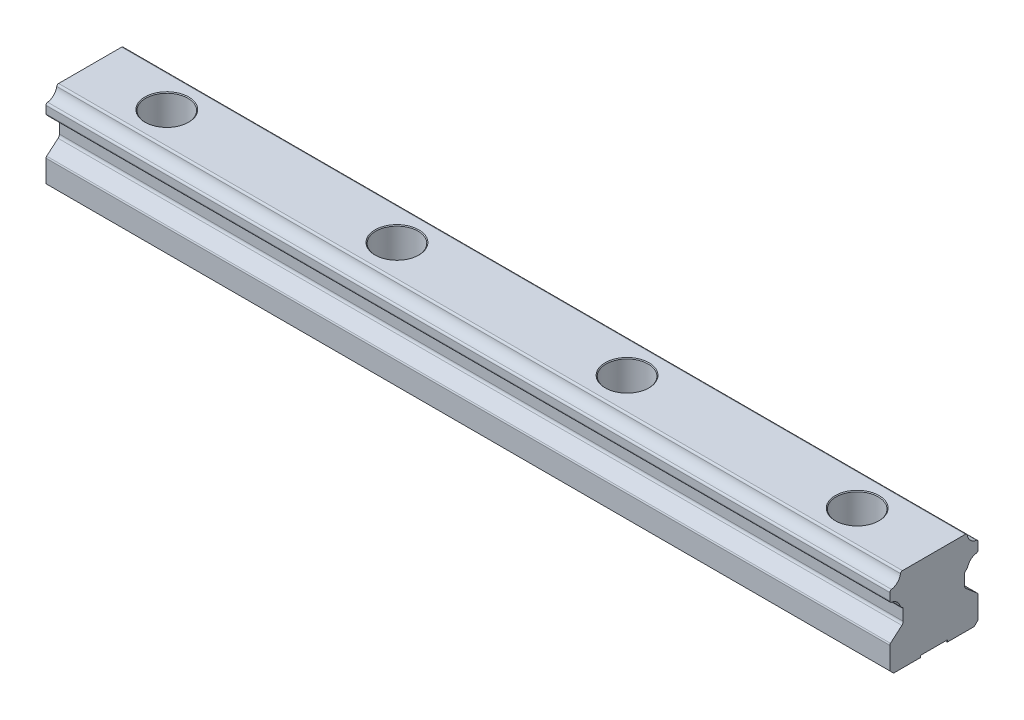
ISO-10303-21;
HEADER;
FILE_DESCRIPTION(('STEP AP214'),'2;1');
FILE_NAME('part.step','',(''),(''),'','','');
FILE_SCHEMA(('AUTOMOTIVE_DESIGN { 1 0 10303 214 1 1 1 1 }'));
ENDSEC;
DATA;
#1=APPLICATION_CONTEXT('core data for automotive mechanical design processes');
#2=APPLICATION_PROTOCOL_DEFINITION('international standard','automotive_design',2000,#1);
#3=PRODUCT_CONTEXT('',#1,'mechanical');
#4=PRODUCT('Part','Part','',(#3));
#5=PRODUCT_RELATED_PRODUCT_CATEGORY('part','',(#4));
#6=PRODUCT_DEFINITION_FORMATION('','',#4);
#7=PRODUCT_DEFINITION_CONTEXT('part definition',#1,'design');
#8=PRODUCT_DEFINITION('design','',#6,#7);
#9=PRODUCT_DEFINITION_SHAPE('','',#8);
#10=(LENGTH_UNIT() NAMED_UNIT(*) SI_UNIT(.MILLI.,.METRE.));
#11=(NAMED_UNIT(*) PLANE_ANGLE_UNIT() SI_UNIT($,.RADIAN.));
#12=(NAMED_UNIT(*) SI_UNIT($,.STERADIAN.) SOLID_ANGLE_UNIT());
#13=UNCERTAINTY_MEASURE_WITH_UNIT(LENGTH_MEASURE(1.E-05),#10,'distance_accuracy_value','');
#14=(GEOMETRIC_REPRESENTATION_CONTEXT(3) GLOBAL_UNCERTAINTY_ASSIGNED_CONTEXT((#13)) GLOBAL_UNIT_ASSIGNED_CONTEXT((#10,
#11,#12)) REPRESENTATION_CONTEXT('',''));
#15=CARTESIAN_POINT('',(0.,0.,0.));
#16=DIRECTION('',(0.,0.,1.));
#17=DIRECTION('',(1.,0.,0.));
#18=AXIS2_PLACEMENT_3D('',#15,#16,#17);
#19=CARTESIAN_POINT('',(220.,0.,-3.5));
#20=DIRECTION('',(0.,0.,1.));
#21=DIRECTION('',(1.,0.,0.));
#22=AXIS2_PLACEMENT_3D('',#19,#20,#21);
#23=PLANE('',#22);
#24=DIRECTION('',(-1.,0.,0.));
#25=VECTOR('',#24,1.);
#26=CARTESIAN_POINT('',(220.,0.5,-3.5));
#27=LINE('',#26,#25);
#28=CARTESIAN_POINT('',(19.812850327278,0.5,-3.5));
#29=VERTEX_POINT('',#28);
#30=CARTESIAN_POINT('',(0.,0.5,-3.5));
#31=VERTEX_POINT('',#30);
#32=EDGE_CURVE('E11',#29,#31,#27,.T.);
#33=ORIENTED_EDGE('',*,*,#32,.T.);
#34=DIRECTION('',(0.,1.,0.));
#35=VECTOR('',#34,1.);
#36=CARTESIAN_POINT('',(0.,0.,-3.5));
#37=LINE('',#36,#35);
#38=CARTESIAN_POINT('',(0.,0.,-3.5));
#39=VERTEX_POINT('',#38);
#40=EDGE_CURVE('E42',#39,#31,#37,.T.);
#41=ORIENTED_EDGE('',*,*,#40,.F.);
#42=DIRECTION('',(-1.,0.,0.));
#43=VECTOR('',#42,1.);
#44=CARTESIAN_POINT('',(220.,0.,-3.5));
#45=LINE('',#44,#43);
#46=CARTESIAN_POINT('',(18.7846708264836,0.,-3.5));
#47=VERTEX_POINT('',#46);
#48=EDGE_CURVE('E617',#47,#39,#45,.T.);
#49=ORIENTED_EDGE('',*,*,#48,.F.);
#50=CARTESIAN_POINT('',(19.8128503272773,0.199999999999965,-3.5));
#51=CARTESIAN_POINT('',(19.7700193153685,0.197717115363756,-3.49999833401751));
#52=CARTESIAN_POINT('',(19.7272295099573,0.194668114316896,-3.49997734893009));
#53=CARTESIAN_POINT('',(19.6418382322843,0.18705770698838,-3.49991996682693));
#54=CARTESIAN_POINT('',(19.599236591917,0.182498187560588,-3.49988358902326));
#55=CARTESIAN_POINT('',(19.5141161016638,0.171867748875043,-3.4998184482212));
#56=CARTESIAN_POINT('',(19.4715977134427,0.165793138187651,-3.49978970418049));
#57=CARTESIAN_POINT('',(19.386539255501,0.152139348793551,-3.49975102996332));
#58=CARTESIAN_POINT('',(19.3440006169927,0.144551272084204,-3.49974121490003));
#59=CARTESIAN_POINT('',(19.2587997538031,0.12787530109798,-3.49974360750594));
#60=CARTESIAN_POINT('',(19.2161401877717,0.118773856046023,-3.49975602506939));
#61=CARTESIAN_POINT('',(19.1305982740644,0.0990757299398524,-3.49979782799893));
#62=CARTESIAN_POINT('',(19.0877199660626,0.0884615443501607,-3.49982742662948));
#63=CARTESIAN_POINT('',(19.001645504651,0.0657415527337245,-3.49989148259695));
#64=CARTESIAN_POINT('',(18.9584548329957,0.0536150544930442,-3.4999260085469));
#65=CARTESIAN_POINT('',(18.8716620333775,0.0278736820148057,-3.49998006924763));
#66=CARTESIAN_POINT('',(18.8280667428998,0.0142357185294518,-3.49999931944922));
#67=CARTESIAN_POINT('',(18.7846708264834,5.07515036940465E-13,-3.50000000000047));
#68=B_SPLINE_CURVE_WITH_KNOTS('',3,(#50,#51,#52,#53,#54,#55,#56,#57,#58,#59,#60,#61,#62,#63,#64,
#65,#66,#67),.UNSPECIFIED.,.F.,.F.,(4,2,2,2,2,2,2,2,4),(0.,0.128668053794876,0.257175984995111,
0.386000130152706,0.515605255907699,0.64644041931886,0.7789354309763,0.913498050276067,
1.05051196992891),.UNSPECIFIED.);
#69=CARTESIAN_POINT('',(19.8128503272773,0.200000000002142,-3.5));
#70=VERTEX_POINT('',#69);
#71=EDGE_CURVE('E990',#70,#47,#68,.T.);
#72=ORIENTED_EDGE('',*,*,#71,.F.);
#73=DIRECTION('',(0.,-1.,0.));
#74=VECTOR('',#73,1.);
#75=CARTESIAN_POINT('',(19.812850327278,0.,-3.5));
#76=LINE('',#75,#74);
#77=EDGE_CURVE('E1167',#29,#70,#76,.T.);
#78=ORIENTED_EDGE('',*,*,#77,.F.);
#79=EDGE_LOOP('',(#33,#41,#49,#72,#78));
#80=FACE_BOUND('',#79,.T.);
#81=ADVANCED_FACE('F17',(#80),#23,.T.);
#82=CARTESIAN_POINT('',(200.,0.2,0.));
#83=DIRECTION('',(0.,-1.,0.));
#84=DIRECTION('',(0.,0.,-1.));
#85=AXIS2_PLACEMENT_3D('',#82,#83,#84);
#86=CONICAL_SURFACE('',#85,3.505,0.7853981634);
#87=CARTESIAN_POINT('',(200.,0.,0.));
#88=DIRECTION('',(0.,-1.,0.));
#89=DIRECTION('',(0.,0.,-1.));
#90=AXIS2_PLACEMENT_3D('',#87,#88,#89);
#91=CIRCLE('',#90,3.705);
#92=CARTESIAN_POINT('',(201.215329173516,0.,3.5));
#93=VERTEX_POINT('',#92);
#94=CARTESIAN_POINT('',(198.784670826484,0.,3.5));
#95=VERTEX_POINT('',#94);
#96=EDGE_CURVE('E28',#93,#95,#91,.T.);
#97=ORIENTED_EDGE('',*,*,#96,.T.);
#98=CARTESIAN_POINT('',(198.784670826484,5.6451696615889E-13,3.50000000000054));
#99=CARTESIAN_POINT('',(198.8280667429,0.0142357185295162,3.49999931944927));
#100=CARTESIAN_POINT('',(198.871662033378,0.0278736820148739,3.49998006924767));
#101=CARTESIAN_POINT('',(198.958454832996,0.0536150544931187,3.49992600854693));
#102=CARTESIAN_POINT('',(199.001645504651,0.0657415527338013,3.49989148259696));
#103=CARTESIAN_POINT('',(199.087719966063,0.0884615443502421,3.49982742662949));
#104=CARTESIAN_POINT('',(199.130598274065,0.0990757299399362,3.49979782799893));
#105=CARTESIAN_POINT('',(199.216140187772,0.118773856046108,3.49975602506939));
#106=CARTESIAN_POINT('',(199.258799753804,0.127875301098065,3.49974360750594));
#107=CARTESIAN_POINT('',(199.344000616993,0.144551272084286,3.49974121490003));
#108=CARTESIAN_POINT('',(199.386539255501,0.152139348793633,3.49975102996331));
#109=CARTESIAN_POINT('',(199.471597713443,0.165793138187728,3.49978970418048));
#110=CARTESIAN_POINT('',(199.514116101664,0.171867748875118,3.49981844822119));
#111=CARTESIAN_POINT('',(199.599236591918,0.182498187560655,3.49988358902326));
#112=CARTESIAN_POINT('',(199.641838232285,0.187057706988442,3.49991996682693));
#113=CARTESIAN_POINT('',(199.727229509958,0.194668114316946,3.49997734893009));
#114=CARTESIAN_POINT('',(199.770019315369,0.1977171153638,3.49999833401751));
#115=CARTESIAN_POINT('',(199.812850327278,0.200000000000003,3.5));
#116=B_SPLINE_CURVE_WITH_KNOTS('',3,(#98,#99,#100,#101,#102,#103,#104,#105,#106,#107,#108,#109,
#110,#111,#112,#113,#114,#115),.UNSPECIFIED.,.F.,.F.,(4,2,2,2,2,2,2,2,4),(0.,0.137013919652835,
0.271576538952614,0.404071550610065,0.534906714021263,0.66451183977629,0.793335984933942,
0.921843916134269,1.05051196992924),.UNSPECIFIED.);
#117=CARTESIAN_POINT('',(199.812850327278,0.2,3.5));
#118=VERTEX_POINT('',#117);
#119=EDGE_CURVE('E1009',#95,#118,#116,.T.);
#120=ORIENTED_EDGE('',*,*,#119,.T.);
#121=CARTESIAN_POINT('',(200.,0.2,0.));
#122=DIRECTION('',(0.,-1.,0.));
#123=DIRECTION('',(0.,0.,-1.));
#124=AXIS2_PLACEMENT_3D('',#121,#122,#123);
#125=CIRCLE('',#124,3.505);
#126=CARTESIAN_POINT('',(200.187149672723,0.200000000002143,3.5));
#127=VERTEX_POINT('',#126);
#128=EDGE_CURVE('E1349',#127,#118,#125,.T.);
#129=ORIENTED_EDGE('',*,*,#128,.F.);
#130=CARTESIAN_POINT('',(200.187149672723,0.199999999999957,3.5));
#131=CARTESIAN_POINT('',(200.229980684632,0.19771711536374,3.49999833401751));
#132=CARTESIAN_POINT('',(200.272770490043,0.194668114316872,3.49997734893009));
#133=CARTESIAN_POINT('',(200.358161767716,0.187057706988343,3.49991996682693));
#134=CARTESIAN_POINT('',(200.400763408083,0.182498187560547,3.49988358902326));
#135=CARTESIAN_POINT('',(200.485883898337,0.171867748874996,3.49981844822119));
#136=CARTESIAN_POINT('',(200.528402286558,0.165793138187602,3.49978970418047));
#137=CARTESIAN_POINT('',(200.613460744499,0.152139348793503,3.4997510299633));
#138=CARTESIAN_POINT('',(200.655999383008,0.144551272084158,3.49974121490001));
#139=CARTESIAN_POINT('',(200.741200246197,0.127875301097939,3.49974360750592));
#140=CARTESIAN_POINT('',(200.783859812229,0.118773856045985,3.49975602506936));
#141=CARTESIAN_POINT('',(200.869401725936,0.0990757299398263,3.4997978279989));
#142=CARTESIAN_POINT('',(200.912280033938,0.088461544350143,3.49982742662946));
#143=CARTESIAN_POINT('',(200.998354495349,0.0657415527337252,3.49989148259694));
#144=CARTESIAN_POINT('',(201.041545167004,0.0536150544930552,3.49992600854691));
#145=CARTESIAN_POINT('',(201.128337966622,0.0278736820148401,3.49998006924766));
#146=CARTESIAN_POINT('',(201.1719332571,0.0142357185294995,3.49999931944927));
#147=CARTESIAN_POINT('',(201.215329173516,5.68013518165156E-13,3.50000000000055));
#148=B_SPLINE_CURVE_WITH_KNOTS('',3,(#130,#131,#132,#133,#134,#135,#136,#137,#138,#139,#140,
#141,#142,#143,#144,#145,#146,#147),.UNSPECIFIED.,.F.,.F.,(4,2,2,2,2,2,2,2,4),(0.,
0.128668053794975,0.257175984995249,0.386000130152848,0.515605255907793,0.646440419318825,
0.778935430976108,0.913498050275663,1.05051196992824),.UNSPECIFIED.);
#149=EDGE_CURVE('E1047',#127,#93,#148,.T.);
#150=ORIENTED_EDGE('',*,*,#149,.T.);
#151=EDGE_LOOP('',(#97,#120,#129,#150));
#152=FACE_BOUND('',#151,.T.);
#153=ADVANCED_FACE('F1016',(#152),#86,.F.);
#154=CARTESIAN_POINT('',(80.,0.2,0.));
#155=DIRECTION('',(0.,-1.,0.));
#156=DIRECTION('',(0.,0.,-1.));
#157=AXIS2_PLACEMENT_3D('',#154,#155,#156);
#158=CONICAL_SURFACE('',#157,3.505,0.7853981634);
#159=CARTESIAN_POINT('',(80.,0.,0.));
#160=DIRECTION('',(0.,-1.,0.));
#161=DIRECTION('',(0.,0.,-1.));
#162=AXIS2_PLACEMENT_3D('',#159,#160,#161);
#163=CIRCLE('',#162,3.705);
#164=CARTESIAN_POINT('',(81.2153291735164,0.,3.5));
#165=VERTEX_POINT('',#164);
#166=CARTESIAN_POINT('',(78.7846708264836,0.,3.5));
#167=VERTEX_POINT('',#166);
#168=EDGE_CURVE('E1814',#165,#167,#163,.T.);
#169=ORIENTED_EDGE('',*,*,#168,.T.);
#170=CARTESIAN_POINT('',(78.7846708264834,5.05997153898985E-13,3.50000000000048));
#171=CARTESIAN_POINT('',(78.8280667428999,0.0142357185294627,3.49999931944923));
#172=CARTESIAN_POINT('',(78.8716620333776,0.027873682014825,3.49998006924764));
#173=CARTESIAN_POINT('',(78.9584548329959,0.053615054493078,3.49992600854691));
#174=CARTESIAN_POINT('',(79.0016455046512,0.0657415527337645,3.49989148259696));
#175=CARTESIAN_POINT('',(79.0877199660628,0.0884615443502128,3.49982742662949));
#176=CARTESIAN_POINT('',(79.1305982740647,0.0990757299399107,3.49979782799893));
#177=CARTESIAN_POINT('',(79.216140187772,0.11877385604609,3.4997560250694));
#178=CARTESIAN_POINT('',(79.2587997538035,0.127875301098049,3.49974360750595));
#179=CARTESIAN_POINT('',(79.3440006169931,0.144551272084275,3.49974121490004));
#180=CARTESIAN_POINT('',(79.3865392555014,0.152139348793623,3.49975102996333));
#181=CARTESIAN_POINT('',(79.4715977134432,0.165793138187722,3.49978970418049));
#182=CARTESIAN_POINT('',(79.5141161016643,0.171867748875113,3.4998184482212));
#183=CARTESIAN_POINT('',(79.5992365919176,0.182498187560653,3.49988358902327));
#184=CARTESIAN_POINT('',(79.6418382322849,0.187057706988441,3.49991996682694));
#185=CARTESIAN_POINT('',(79.727229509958,0.194668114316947,3.49997734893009));
#186=CARTESIAN_POINT('',(79.7700193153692,0.197717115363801,3.49999833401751));
#187=CARTESIAN_POINT('',(79.812850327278,0.200000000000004,3.5));
#188=B_SPLINE_CURVE_WITH_KNOTS('',3,(#170,#171,#172,#173,#174,#175,#176,#177,#178,#179,#180,
#181,#182,#183,#184,#185,#186,#187),.UNSPECIFIED.,.F.,.F.,(4,2,2,2,2,2,2,2,4),(0.,
0.137013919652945,0.271576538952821,0.404071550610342,0.534906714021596,0.664511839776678,
0.793335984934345,0.921843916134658,1.0505119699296),.UNSPECIFIED.);
#189=CARTESIAN_POINT('',(79.812850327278,0.2,3.5));
#190=VERTEX_POINT('',#189);
#191=EDGE_CURVE('E1894',#167,#190,#188,.T.);
#192=ORIENTED_EDGE('',*,*,#191,.T.);
#193=CARTESIAN_POINT('',(80.,0.2,0.));
#194=DIRECTION('',(0.,-1.,0.));
#195=DIRECTION('',(0.,0.,-1.));
#196=AXIS2_PLACEMENT_3D('',#193,#194,#195);
#197=CIRCLE('',#196,3.505);
#198=CARTESIAN_POINT('',(80.1871496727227,0.200000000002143,3.5));
#199=VERTEX_POINT('',#198);
#200=EDGE_CURVE('E1751',#199,#190,#197,.T.);
#201=ORIENTED_EDGE('',*,*,#200,.F.);
#202=CARTESIAN_POINT('',(80.1871496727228,0.199999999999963,3.5));
#203=CARTESIAN_POINT('',(80.2299806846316,0.197717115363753,3.49999833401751));
#204=CARTESIAN_POINT('',(80.2727704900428,0.194668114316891,3.49997734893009));
#205=CARTESIAN_POINT('',(80.3581617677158,0.187057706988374,3.49991996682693));
#206=CARTESIAN_POINT('',(80.4007634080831,0.182498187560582,3.49988358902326));
#207=CARTESIAN_POINT('',(80.4858838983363,0.171867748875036,3.4998184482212));
#208=CARTESIAN_POINT('',(80.5284022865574,0.165793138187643,3.49978970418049));
#209=CARTESIAN_POINT('',(80.6134607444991,0.152139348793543,3.49975102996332));
#210=CARTESIAN_POINT('',(80.6559993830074,0.144551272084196,3.49974121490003));
#211=CARTESIAN_POINT('',(80.7412002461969,0.127875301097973,3.49974360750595));
#212=CARTESIAN_POINT('',(80.7838598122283,0.118773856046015,3.49975602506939));
#213=CARTESIAN_POINT('',(80.8694017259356,0.099075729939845,3.49979782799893));
#214=CARTESIAN_POINT('',(80.9122800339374,0.0884615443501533,3.49982742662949));
#215=CARTESIAN_POINT('',(80.998354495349,0.0657415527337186,3.49989148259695));
#216=CARTESIAN_POINT('',(81.0415451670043,0.0536150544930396,3.49992600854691));
#217=CARTESIAN_POINT('',(81.1283379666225,0.0278736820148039,3.49998006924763));
#218=CARTESIAN_POINT('',(81.1719332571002,0.0142357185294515,3.49999931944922));
#219=CARTESIAN_POINT('',(81.2153291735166,5.07000040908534E-13,3.50000000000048));
#220=B_SPLINE_CURVE_WITH_KNOTS('',3,(#202,#203,#204,#205,#206,#207,#208,#209,#210,#211,#212,
#213,#214,#215,#216,#217,#218,#219),.UNSPECIFIED.,.F.,.F.,(4,2,2,2,2,2,2,2,4),(0.,
0.128668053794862,0.25717598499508,0.386000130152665,0.515605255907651,0.646440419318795,
0.778935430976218,0.913498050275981,1.05051196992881),.UNSPECIFIED.);
#221=EDGE_CURVE('E1769',#199,#165,#220,.T.);
#222=ORIENTED_EDGE('',*,*,#221,.T.);
#223=EDGE_LOOP('',(#169,#192,#201,#222));
#224=FACE_BOUND('',#223,.T.);
#225=ADVANCED_FACE('F1026',(#224),#158,.F.);
#226=CARTESIAN_POINT('',(20.,0.2,0.));
#227=DIRECTION('',(0.,-1.,0.));
#228=DIRECTION('',(0.,0.,-1.));
#229=AXIS2_PLACEMENT_3D('',#226,#227,#228);
#230=CONICAL_SURFACE('',#229,3.505,0.7853981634);
#231=CARTESIAN_POINT('',(20.,0.,0.));
#232=DIRECTION('',(0.,-1.,0.));
#233=DIRECTION('',(0.,0.,-1.));
#234=AXIS2_PLACEMENT_3D('',#231,#232,#233);
#235=CIRCLE('',#234,3.705);
#236=CARTESIAN_POINT('',(21.2153291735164,0.,3.5));
#237=VERTEX_POINT('',#236);
#238=CARTESIAN_POINT('',(18.7846708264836,0.,3.5));
#239=VERTEX_POINT('',#238);
#240=EDGE_CURVE('E1765',#237,#239,#235,.T.);
#241=ORIENTED_EDGE('',*,*,#240,.T.);
#242=CARTESIAN_POINT('',(18.7846708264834,5.08002927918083E-13,3.50000000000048));
#243=CARTESIAN_POINT('',(18.8280667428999,0.0142357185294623,3.49999931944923));
#244=CARTESIAN_POINT('',(18.8716620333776,0.0278736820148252,3.49998006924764));
#245=CARTESIAN_POINT('',(18.9584548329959,0.0536150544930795,3.49992600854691));
#246=CARTESIAN_POINT('',(19.0016455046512,0.0657415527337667,3.49989148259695));
#247=CARTESIAN_POINT('',(19.0877199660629,0.0884615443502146,3.49982742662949));
#248=CARTESIAN_POINT('',(19.1305982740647,0.0990757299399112,3.49979782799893));
#249=CARTESIAN_POINT('',(19.216140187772,0.118773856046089,3.4997560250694));
#250=CARTESIAN_POINT('',(19.2587997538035,0.127875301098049,3.49974360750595));
#251=CARTESIAN_POINT('',(19.3440006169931,0.144551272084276,3.49974121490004));
#252=CARTESIAN_POINT('',(19.3865392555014,0.152139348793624,3.49975102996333));
#253=CARTESIAN_POINT('',(19.4715977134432,0.165793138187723,3.49978970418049));
#254=CARTESIAN_POINT('',(19.5141161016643,0.171867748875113,3.4998184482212));
#255=CARTESIAN_POINT('',(19.5992365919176,0.182498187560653,3.49988358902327));
#256=CARTESIAN_POINT('',(19.6418382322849,0.187057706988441,3.49991996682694));
#257=CARTESIAN_POINT('',(19.727229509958,0.194668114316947,3.49997734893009));
#258=CARTESIAN_POINT('',(19.7700193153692,0.197717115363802,3.49999833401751));
#259=CARTESIAN_POINT('',(19.812850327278,0.200000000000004,3.5));
#260=B_SPLINE_CURVE_WITH_KNOTS('',3,(#242,#243,#244,#245,#246,#247,#248,#249,#250,#251,#252,
#253,#254,#255,#256,#257,#258,#259),.UNSPECIFIED.,.F.,.F.,(4,2,2,2,2,2,2,2,4),(0.,
0.137013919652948,0.271576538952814,0.404071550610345,0.534906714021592,0.664511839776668,
0.793335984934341,0.921843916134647,1.0505119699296),.UNSPECIFIED.);
#261=CARTESIAN_POINT('',(19.812850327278,0.2,3.5));
#262=VERTEX_POINT('',#261);
#263=EDGE_CURVE('E1770',#239,#262,#260,.T.);
#264=ORIENTED_EDGE('',*,*,#263,.T.);
#265=CARTESIAN_POINT('',(20.,0.2,0.));
#266=DIRECTION('',(0.,-1.,0.));
#267=DIRECTION('',(0.,0.,-1.));
#268=AXIS2_PLACEMENT_3D('',#265,#266,#267);
#269=CIRCLE('',#268,3.505);
#270=CARTESIAN_POINT('',(20.1871496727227,0.200000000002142,3.5));
#271=VERTEX_POINT('',#270);
#272=EDGE_CURVE('E1454',#271,#262,#269,.T.);
#273=ORIENTED_EDGE('',*,*,#272,.F.);
#274=CARTESIAN_POINT('',(20.1871496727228,0.199999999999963,3.5));
#275=CARTESIAN_POINT('',(20.2299806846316,0.197717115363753,3.49999833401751));
#276=CARTESIAN_POINT('',(20.2727704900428,0.194668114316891,3.49997734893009));
#277=CARTESIAN_POINT('',(20.3581617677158,0.187057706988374,3.49991996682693));
#278=CARTESIAN_POINT('',(20.4007634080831,0.182498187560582,3.49988358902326));
#279=CARTESIAN_POINT('',(20.4858838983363,0.171867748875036,3.4998184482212));
#280=CARTESIAN_POINT('',(20.5284022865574,0.165793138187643,3.49978970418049));
#281=CARTESIAN_POINT('',(20.6134607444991,0.152139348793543,3.49975102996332));
#282=CARTESIAN_POINT('',(20.6559993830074,0.144551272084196,3.49974121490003));
#283=CARTESIAN_POINT('',(20.7412002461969,0.127875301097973,3.49974360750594));
#284=CARTESIAN_POINT('',(20.7838598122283,0.118773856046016,3.49975602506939));
#285=CARTESIAN_POINT('',(20.8694017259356,0.0990757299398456,3.49979782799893));
#286=CARTESIAN_POINT('',(20.9122800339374,0.0884615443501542,3.49982742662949));
#287=CARTESIAN_POINT('',(20.998354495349,0.0657415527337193,3.49989148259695));
#288=CARTESIAN_POINT('',(21.0415451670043,0.05361505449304,3.49992600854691));
#289=CARTESIAN_POINT('',(21.1283379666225,0.0278736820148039,3.49998006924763));
#290=CARTESIAN_POINT('',(21.1719332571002,0.0142357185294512,3.49999931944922));
#291=CARTESIAN_POINT('',(21.2153291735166,5.07515036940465E-13,3.50000000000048));
#292=B_SPLINE_CURVE_WITH_KNOTS('',3,(#274,#275,#276,#277,#278,#279,#280,#281,#282,#283,#284,
#285,#286,#287,#288,#289,#290,#291),.UNSPECIFIED.,.F.,.F.,(4,2,2,2,2,2,2,2,4),(0.,
0.128668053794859,0.257175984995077,0.386000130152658,0.515605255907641,0.646440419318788,
0.778935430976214,0.913498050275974,1.05051196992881),.UNSPECIFIED.);
#293=EDGE_CURVE('E858',#271,#237,#292,.T.);
#294=ORIENTED_EDGE('',*,*,#293,.T.);
#295=EDGE_LOOP('',(#241,#264,#273,#294));
#296=FACE_BOUND('',#295,.T.);
#297=ADVANCED_FACE('F1244',(#296),#230,.F.);
#298=CARTESIAN_POINT('',(20.,0.,0.));
#299=DIRECTION('',(0.,1.,0.));
#300=DIRECTION('',(0.,0.,-1.));
#301=AXIS2_PLACEMENT_3D('',#298,#299,#300);
#302=CYLINDRICAL_SURFACE('',#301,3.505);
#303=CARTESIAN_POINT('',(20.,13.,0.));
#304=DIRECTION('',(0.,-1.,0.));
#305=DIRECTION('',(0.,0.,-1.));
#306=AXIS2_PLACEMENT_3D('',#303,#304,#305);
#307=CIRCLE('',#306,3.505);
#308=CARTESIAN_POINT('',(20.,13.,-3.505));
#309=VERTEX_POINT('',#308);
#310=EDGE_CURVE('E735',#309,#309,#307,.T.);
#311=ORIENTED_EDGE('',*,*,#310,.F.);
#312=EDGE_LOOP('',(#311));
#313=FACE_BOUND('',#312,.T.);
#314=CARTESIAN_POINT('',(20.,0.5,0.));
#315=DIRECTION('',(0.,-1.,0.));
#316=DIRECTION('',(0.,0.,-1.));
#317=AXIS2_PLACEMENT_3D('',#314,#315,#316);
#318=CIRCLE('',#317,3.505);
#319=CARTESIAN_POINT('',(20.187149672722,0.5,-3.5));
#320=VERTEX_POINT('',#319);
#321=CARTESIAN_POINT('',(20.187149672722,0.5,3.5));
#322=VERTEX_POINT('',#321);
#323=EDGE_CURVE('E854',#320,#322,#318,.T.);
#324=ORIENTED_EDGE('',*,*,#323,.T.);
#325=DIRECTION('',(0.,-1.,0.));
#326=VECTOR('',#325,1.);
#327=CARTESIAN_POINT('',(20.187149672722,0.,3.5));
#328=LINE('',#327,#326);
#329=EDGE_CURVE('E859',#322,#271,#328,.T.);
#330=ORIENTED_EDGE('',*,*,#329,.T.);
#331=ORIENTED_EDGE('',*,*,#272,.T.);
#332=DIRECTION('',(0.,1.,0.));
#333=VECTOR('',#332,1.);
#334=CARTESIAN_POINT('',(19.812850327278,0.,3.5));
#335=LINE('',#334,#333);
#336=CARTESIAN_POINT('',(19.812850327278,0.5,3.5));
#337=VERTEX_POINT('',#336);
#338=EDGE_CURVE('E1551',#262,#337,#335,.T.);
#339=ORIENTED_EDGE('',*,*,#338,.T.);
#340=CARTESIAN_POINT('',(20.,0.5,0.));
#341=DIRECTION('',(0.,-1.,0.));
#342=DIRECTION('',(0.,0.,-1.));
#343=AXIS2_PLACEMENT_3D('',#340,#341,#342);
#344=CIRCLE('',#343,3.505);
#345=EDGE_CURVE('E1546',#337,#29,#344,.T.);
#346=ORIENTED_EDGE('',*,*,#345,.T.);
#347=ORIENTED_EDGE('',*,*,#77,.T.);
#348=CARTESIAN_POINT('',(20.,0.2,0.));
#349=DIRECTION('',(0.,-1.,0.));
#350=DIRECTION('',(0.,0.,-1.));
#351=AXIS2_PLACEMENT_3D('',#348,#349,#350);
#352=CIRCLE('',#351,3.505);
#353=CARTESIAN_POINT('',(20.187149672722,0.2,-3.5));
#354=VERTEX_POINT('',#353);
#355=EDGE_CURVE('E1536',#70,#354,#352,.T.);
#356=ORIENTED_EDGE('',*,*,#355,.T.);
#357=DIRECTION('',(0.,1.,0.));
#358=VECTOR('',#357,1.);
#359=CARTESIAN_POINT('',(20.187149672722,0.,-3.5));
#360=LINE('',#359,#358);
#361=EDGE_CURVE('E739',#354,#320,#360,.T.);
#362=ORIENTED_EDGE('',*,*,#361,.T.);
#363=EDGE_LOOP('',(#324,#330,#331,#339,#346,#347,#356,#362));
#364=FACE_BOUND('',#363,.T.);
#365=ADVANCED_FACE('F1683',(#313,#364),#302,.F.);
#366=CARTESIAN_POINT('',(25.505,13.,0.));
#367=DIRECTION('',(0.,1.,0.));
#368=DIRECTION('',(1.,0.,0.));
#369=AXIS2_PLACEMENT_3D('',#366,#367,#368);
#370=PLANE('',#369);
#371=CARTESIAN_POINT('',(20.,13.,0.));
#372=DIRECTION('',(0.,-1.,0.));
#373=DIRECTION('',(0.,0.,-1.));
#374=AXIS2_PLACEMENT_3D('',#371,#372,#373);
#375=CIRCLE('',#374,5.505);
#376=CARTESIAN_POINT('',(20.,13.,-5.505));
#377=VERTEX_POINT('',#376);
#378=EDGE_CURVE('E684',#377,#377,#375,.T.);
#379=ORIENTED_EDGE('',*,*,#378,.F.);
#380=EDGE_LOOP('',(#379));
#381=FACE_BOUND('',#380,.T.);
#382=ORIENTED_EDGE('',*,*,#310,.T.);
#383=EDGE_LOOP('',(#382));
#384=FACE_BOUND('',#383,.T.);
#385=ADVANCED_FACE('F1666',(#381,#384),#370,.T.);
#386=CARTESIAN_POINT('',(20.,0.,0.));
#387=DIRECTION('',(0.,1.,0.));
#388=DIRECTION('',(0.,0.,-1.));
#389=AXIS2_PLACEMENT_3D('',#386,#387,#388);
#390=CYLINDRICAL_SURFACE('',#389,5.505);
#391=CARTESIAN_POINT('',(20.,21.8,0.));
#392=DIRECTION('',(0.,-1.,0.));
#393=DIRECTION('',(0.,0.,-1.));
#394=AXIS2_PLACEMENT_3D('',#391,#392,#393);
#395=CIRCLE('',#394,5.505);
#396=CARTESIAN_POINT('',(20.,21.8,-5.505));
#397=VERTEX_POINT('',#396);
#398=EDGE_CURVE('E680',#397,#397,#395,.T.);
#399=ORIENTED_EDGE('',*,*,#398,.F.);
#400=EDGE_LOOP('',(#399));
#401=FACE_BOUND('',#400,.T.);
#402=ORIENTED_EDGE('',*,*,#378,.T.);
#403=EDGE_LOOP('',(#402));
#404=FACE_BOUND('',#403,.T.);
#405=ADVANCED_FACE('F1669',(#401,#404),#390,.F.);
#406=CARTESIAN_POINT('',(20.,22.,0.));
#407=DIRECTION('',(0.,1.,0.));
#408=DIRECTION('',(0.,0.,1.));
#409=AXIS2_PLACEMENT_3D('',#406,#407,#408);
#410=CONICAL_SURFACE('',#409,5.705,0.7853981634);
#411=CARTESIAN_POINT('',(20.,22.,0.));
#412=DIRECTION('',(0.,-1.,0.));
#413=DIRECTION('',(0.,0.,-1.));
#414=AXIS2_PLACEMENT_3D('',#411,#412,#413);
#415=CIRCLE('',#414,5.705);
#416=CARTESIAN_POINT('',(20.,22.,-5.705));
#417=VERTEX_POINT('',#416);
#418=EDGE_CURVE('E877',#417,#417,#415,.T.);
#419=ORIENTED_EDGE('',*,*,#418,.F.);
#420=EDGE_LOOP('',(#419));
#421=FACE_BOUND('',#420,.T.);
#422=ORIENTED_EDGE('',*,*,#398,.T.);
#423=EDGE_LOOP('',(#422));
#424=FACE_BOUND('',#423,.T.);
#425=ADVANCED_FACE('F1671',(#421,#424),#410,.F.);
#426=CARTESIAN_POINT('',(145.505,13.,0.));
#427=DIRECTION('',(0.,1.,0.));
#428=DIRECTION('',(1.,0.,0.));
#429=AXIS2_PLACEMENT_3D('',#426,#427,#428);
#430=PLANE('',#429);
#431=CARTESIAN_POINT('',(140.,13.,0.));
#432=DIRECTION('',(0.,-1.,0.));
#433=DIRECTION('',(0.,0.,-1.));
#434=AXIS2_PLACEMENT_3D('',#431,#432,#433);
#435=CIRCLE('',#434,5.505);
#436=CARTESIAN_POINT('',(140.,13.,-5.505));
#437=VERTEX_POINT('',#436);
#438=EDGE_CURVE('E655',#437,#437,#435,.T.);
#439=ORIENTED_EDGE('',*,*,#438,.F.);
#440=EDGE_LOOP('',(#439));
#441=FACE_BOUND('',#440,.T.);
#442=CARTESIAN_POINT('',(140.,13.,0.));
#443=DIRECTION('',(0.,-1.,0.));
#444=DIRECTION('',(0.,0.,-1.));
#445=AXIS2_PLACEMENT_3D('',#442,#443,#444);
#446=CIRCLE('',#445,3.505);
#447=CARTESIAN_POINT('',(140.,13.,-3.505));
#448=VERTEX_POINT('',#447);
#449=EDGE_CURVE('E638',#448,#448,#446,.T.);
#450=ORIENTED_EDGE('',*,*,#449,.T.);
#451=EDGE_LOOP('',(#450));
#452=FACE_BOUND('',#451,.T.);
#453=ADVANCED_FACE('F1680',(#441,#452),#430,.T.);
#454=CARTESIAN_POINT('',(220.,0.,10.5));
#455=DIRECTION('',(0.,1.,0.));
#456=DIRECTION('',(1.,0.,0.));
#457=AXIS2_PLACEMENT_3D('',#454,#455,#456);
#458=PLANE('',#457);
#459=DIRECTION('',(-1.,0.,0.));
#460=VECTOR('',#459,1.);
#461=CARTESIAN_POINT('',(220.,0.,3.5));
#462=LINE('',#461,#460);
#463=CARTESIAN_POINT('',(220.,0.,3.5));
#464=VERTEX_POINT('',#463);
#465=EDGE_CURVE('E768',#464,#93,#462,.T.);
#466=ORIENTED_EDGE('',*,*,#465,.F.);
#467=DIRECTION('',(0.,0.,-1.));
#468=VECTOR('',#467,1.);
#469=CARTESIAN_POINT('',(220.,0.,10.5));
#470=LINE('',#469,#468);
#471=CARTESIAN_POINT('',(220.,0.,10.5));
#472=VERTEX_POINT('',#471);
#473=EDGE_CURVE('E749',#472,#464,#470,.T.);
#474=ORIENTED_EDGE('',*,*,#473,.F.);
#475=DIRECTION('',(-1.,0.,0.));
#476=VECTOR('',#475,1.);
#477=CARTESIAN_POINT('',(220.,0.,10.5));
#478=LINE('',#477,#476);
#479=CARTESIAN_POINT('',(0.,0.,10.5));
#480=VERTEX_POINT('',#479);
#481=EDGE_CURVE('E616',#472,#480,#478,.T.);
#482=ORIENTED_EDGE('',*,*,#481,.T.);
#483=DIRECTION('',(0.,0.,-1.));
#484=VECTOR('',#483,1.);
#485=CARTESIAN_POINT('',(0.,0.,10.5));
#486=LINE('',#485,#484);
#487=CARTESIAN_POINT('',(0.,0.,3.5));
#488=VERTEX_POINT('',#487);
#489=EDGE_CURVE('E612',#480,#488,#486,.T.);
#490=ORIENTED_EDGE('',*,*,#489,.T.);
#491=DIRECTION('',(-1.,0.,0.));
#492=VECTOR('',#491,1.);
#493=CARTESIAN_POINT('',(220.,0.,3.5));
#494=LINE('',#493,#492);
#495=EDGE_CURVE('E843',#239,#488,#494,.T.);
#496=ORIENTED_EDGE('',*,*,#495,.F.);
#497=ORIENTED_EDGE('',*,*,#240,.F.);
#498=DIRECTION('',(-1.,0.,0.));
#499=VECTOR('',#498,1.);
#500=CARTESIAN_POINT('',(220.,0.,3.5));
#501=LINE('',#500,#499);
#502=EDGE_CURVE('E833',#167,#237,#501,.T.);
#503=ORIENTED_EDGE('',*,*,#502,.F.);
#504=ORIENTED_EDGE('',*,*,#168,.F.);
#505=DIRECTION('',(-1.,0.,0.));
#506=VECTOR('',#505,1.);
#507=CARTESIAN_POINT('',(220.,0.,3.5));
#508=LINE('',#507,#506);
#509=CARTESIAN_POINT('',(138.784670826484,0.,3.5));
#510=VERTEX_POINT('',#509);
#511=EDGE_CURVE('E722',#510,#165,#508,.T.);
#512=ORIENTED_EDGE('',*,*,#511,.F.);
#513=CARTESIAN_POINT('',(140.,0.,0.));
#514=DIRECTION('',(0.,-1.,0.));
#515=DIRECTION('',(0.,0.,-1.));
#516=AXIS2_PLACEMENT_3D('',#513,#514,#515);
#517=CIRCLE('',#516,3.705);
#518=CARTESIAN_POINT('',(141.215329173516,0.,3.5));
#519=VERTEX_POINT('',#518);
#520=EDGE_CURVE('E1221',#519,#510,#517,.T.);
#521=ORIENTED_EDGE('',*,*,#520,.F.);
#522=DIRECTION('',(-1.,0.,0.));
#523=VECTOR('',#522,1.);
#524=CARTESIAN_POINT('',(220.,0.,3.5));
#525=LINE('',#524,#523);
#526=EDGE_CURVE('E810',#95,#519,#525,.T.);
#527=ORIENTED_EDGE('',*,*,#526,.F.);
#528=ORIENTED_EDGE('',*,*,#96,.F.);
#529=EDGE_LOOP('',(#466,#474,#482,#490,#496,#497,#503,#504,#512,#521,#527,#528));
#530=FACE_BOUND('',#529,.T.);
#531=ADVANCED_FACE('F1084',(#530),#458,.F.);
#532=CARTESIAN_POINT('',(220.,0.,10.5));
#533=DIRECTION('',(0.,1.,0.));
#534=DIRECTION('',(1.,0.,0.));
#535=AXIS2_PLACEMENT_3D('',#532,#533,#534);
#536=PLANE('',#535);
#537=ORIENTED_EDGE('',*,*,#48,.T.);
#538=DIRECTION('',(0.,0.,-1.));
#539=VECTOR('',#538,1.);
#540=CARTESIAN_POINT('',(0.,0.,10.5));
#541=LINE('',#540,#539);
#542=CARTESIAN_POINT('',(0.,0.,-10.5));
#543=VERTEX_POINT('',#542);
#544=EDGE_CURVE('E700',#39,#543,#541,.T.);
#545=ORIENTED_EDGE('',*,*,#544,.T.);
#546=DIRECTION('',(-1.,0.,0.));
#547=VECTOR('',#546,1.);
#548=CARTESIAN_POINT('',(220.,0.,-10.5));
#549=LINE('',#548,#547);
#550=CARTESIAN_POINT('',(220.,0.,-10.5));
#551=VERTEX_POINT('',#550);
#552=EDGE_CURVE('E621',#551,#543,#549,.T.);
#553=ORIENTED_EDGE('',*,*,#552,.F.);
#554=DIRECTION('',(0.,0.,-1.));
#555=VECTOR('',#554,1.);
#556=CARTESIAN_POINT('',(220.,0.,10.5));
#557=LINE('',#556,#555);
#558=CARTESIAN_POINT('',(220.,0.,-3.5));
#559=VERTEX_POINT('',#558);
#560=EDGE_CURVE('E750',#559,#551,#557,.T.);
#561=ORIENTED_EDGE('',*,*,#560,.F.);
#562=DIRECTION('',(-1.,0.,0.));
#563=VECTOR('',#562,1.);
#564=CARTESIAN_POINT('',(220.,0.,-3.5));
#565=LINE('',#564,#563);
#566=CARTESIAN_POINT('',(201.215329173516,0.,-3.5));
#567=VERTEX_POINT('',#566);
#568=EDGE_CURVE('E704',#559,#567,#565,.T.);
#569=ORIENTED_EDGE('',*,*,#568,.T.);
#570=CARTESIAN_POINT('',(200.,0.,0.));
#571=DIRECTION('',(0.,-1.,0.));
#572=DIRECTION('',(0.,0.,-1.));
#573=AXIS2_PLACEMENT_3D('',#570,#571,#572);
#574=CIRCLE('',#573,3.705);
#575=CARTESIAN_POINT('',(198.784670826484,0.,-3.5));
#576=VERTEX_POINT('',#575);
#577=EDGE_CURVE('E268',#576,#567,#574,.T.);
#578=ORIENTED_EDGE('',*,*,#577,.F.);
#579=DIRECTION('',(-1.,0.,0.));
#580=VECTOR('',#579,1.);
#581=CARTESIAN_POINT('',(220.,0.,-3.5));
#582=LINE('',#581,#580);
#583=CARTESIAN_POINT('',(141.215329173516,0.,-3.5));
#584=VERTEX_POINT('',#583);
#585=EDGE_CURVE('E1266',#576,#584,#582,.T.);
#586=ORIENTED_EDGE('',*,*,#585,.T.);
#587=CARTESIAN_POINT('',(140.,0.,0.));
#588=DIRECTION('',(0.,-1.,0.));
#589=DIRECTION('',(0.,0.,-1.));
#590=AXIS2_PLACEMENT_3D('',#587,#588,#589);
#591=CIRCLE('',#590,3.705);
#592=CARTESIAN_POINT('',(138.784670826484,0.,-3.5));
#593=VERTEX_POINT('',#592);
#594=EDGE_CURVE('E1224',#593,#584,#591,.T.);
#595=ORIENTED_EDGE('',*,*,#594,.F.);
#596=DIRECTION('',(-1.,0.,0.));
#597=VECTOR('',#596,1.);
#598=CARTESIAN_POINT('',(220.,0.,-3.5));
#599=LINE('',#598,#597);
#600=CARTESIAN_POINT('',(81.2153291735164,0.,-3.5));
#601=VERTEX_POINT('',#600);
#602=EDGE_CURVE('E1269',#593,#601,#599,.T.);
#603=ORIENTED_EDGE('',*,*,#602,.T.);
#604=CARTESIAN_POINT('',(80.,0.,0.));
#605=DIRECTION('',(0.,-1.,0.));
#606=DIRECTION('',(0.,0.,-1.));
#607=AXIS2_PLACEMENT_3D('',#604,#605,#606);
#608=CIRCLE('',#607,3.705);
#609=CARTESIAN_POINT('',(78.7846708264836,0.,-3.5));
#610=VERTEX_POINT('',#609);
#611=EDGE_CURVE('E1480',#610,#601,#608,.T.);
#612=ORIENTED_EDGE('',*,*,#611,.F.);
#613=DIRECTION('',(-1.,0.,0.));
#614=VECTOR('',#613,1.);
#615=CARTESIAN_POINT('',(220.,0.,-3.5));
#616=LINE('',#615,#614);
#617=CARTESIAN_POINT('',(21.2153291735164,0.,-3.5));
#618=VERTEX_POINT('',#617);
#619=EDGE_CURVE('E1576',#610,#618,#616,.T.);
#620=ORIENTED_EDGE('',*,*,#619,.T.);
#621=CARTESIAN_POINT('',(20.,0.,0.));
#622=DIRECTION('',(0.,-1.,0.));
#623=DIRECTION('',(0.,0.,-1.));
#624=AXIS2_PLACEMENT_3D('',#621,#622,#623);
#625=CIRCLE('',#624,3.705);
#626=EDGE_CURVE('E1524',#47,#618,#625,.T.);
#627=ORIENTED_EDGE('',*,*,#626,.F.);
#628=EDGE_LOOP('',(#537,#545,#553,#561,#569,#578,#586,#595,#603,#612,#620,#627));
#629=FACE_BOUND('',#628,.T.);
#630=ADVANCED_FACE('F1080',(#629),#536,.F.);
#631=CARTESIAN_POINT('',(220.,1.,11.5));
#632=DIRECTION('',(0.,0.707106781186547,-0.707106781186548));
#633=DIRECTION('',(-1.,0.,0.));
#634=AXIS2_PLACEMENT_3D('',#631,#632,#633);
#635=PLANE('',#634);
#636=DIRECTION('',(0.,-0.707106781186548,-0.707106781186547));
#637=VECTOR('',#636,1.);
#638=CARTESIAN_POINT('',(0.,1.,11.5));
#639=LINE('',#638,#637);
#640=CARTESIAN_POINT('',(0.,1.,11.5));
#641=VERTEX_POINT('',#640);
#642=EDGE_CURVE('E1572',#641,#480,#639,.T.);
#643=ORIENTED_EDGE('',*,*,#642,.T.);
#644=ORIENTED_EDGE('',*,*,#481,.F.);
#645=DIRECTION('',(0.,-0.707106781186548,-0.707106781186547));
#646=VECTOR('',#645,1.);
#647=CARTESIAN_POINT('',(220.,1.,11.5));
#648=LINE('',#647,#646);
#649=CARTESIAN_POINT('',(220.,1.,11.5));
#650=VERTEX_POINT('',#649);
#651=EDGE_CURVE('E675',#650,#472,#648,.T.);
#652=ORIENTED_EDGE('',*,*,#651,.F.);
#653=DIRECTION('',(-1.,0.,0.));
#654=VECTOR('',#653,1.);
#655=CARTESIAN_POINT('',(220.,1.,11.5));
#656=LINE('',#655,#654);
#657=EDGE_CURVE('E960',#650,#641,#656,.T.);
#658=ORIENTED_EDGE('',*,*,#657,.T.);
#659=EDGE_LOOP('',(#643,#644,#652,#658));
#660=FACE_BOUND('',#659,.T.);
#661=ADVANCED_FACE('F1083',(#660),#635,.F.);
#662=CARTESIAN_POINT('',(220.,6.77003253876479,11.5));
#663=DIRECTION('',(0.,0.,-1.));
#664=DIRECTION('',(0.,-1.,0.));
#665=AXIS2_PLACEMENT_3D('',#662,#663,#664);
#666=PLANE('',#665);
#667=DIRECTION('',(0.,-1.,0.));
#668=VECTOR('',#667,1.);
#669=CARTESIAN_POINT('',(0.,6.77003253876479,11.5));
#670=LINE('',#669,#668);
#671=CARTESIAN_POINT('',(0.,6.77003253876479,11.5));
#672=VERTEX_POINT('',#671);
#673=EDGE_CURVE('E783',#672,#641,#670,.T.);
#674=ORIENTED_EDGE('',*,*,#673,.T.);
#675=ORIENTED_EDGE('',*,*,#657,.F.);
#676=DIRECTION('',(0.,-1.,0.));
#677=VECTOR('',#676,1.);
#678=CARTESIAN_POINT('',(220.,6.77003253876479,11.5));
#679=LINE('',#678,#677);
#680=CARTESIAN_POINT('',(220.,6.77003253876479,11.5));
#681=VERTEX_POINT('',#680);
#682=EDGE_CURVE('E594',#681,#650,#679,.T.);
#683=ORIENTED_EDGE('',*,*,#682,.F.);
#684=DIRECTION('',(-1.,0.,0.));
#685=VECTOR('',#684,1.);
#686=CARTESIAN_POINT('',(220.,6.77003253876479,11.5));
#687=LINE('',#686,#685);
#688=EDGE_CURVE('E780',#681,#672,#687,.T.);
#689=ORIENTED_EDGE('',*,*,#688,.T.);
#690=EDGE_LOOP('',(#674,#675,#683,#689));
#691=FACE_BOUND('',#690,.T.);
#692=ADVANCED_FACE('F1963',(#691),#666,.F.);
#693=CARTESIAN_POINT('',(220.,6.77003253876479,11.));
#694=DIRECTION('',(1.,0.,0.));
#695=DIRECTION('',(0.,0.,1.));
#696=AXIS2_PLACEMENT_3D('',#693,#694,#695);
#697=CYLINDRICAL_SURFACE('',#696,0.5);
#698=CARTESIAN_POINT('',(0.,6.77003253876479,11.));
#699=DIRECTION('',(1.,0.,0.));
#700=DIRECTION('',(0.,0.,-1.));
#701=AXIS2_PLACEMENT_3D('',#698,#699,#700);
#702=CIRCLE('',#701,0.5);
#703=CARTESIAN_POINT('',(0.,7.14966083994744,11.325395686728));
#704=VERTEX_POINT('',#703);
#705=EDGE_CURVE('E784',#704,#672,#702,.T.);
#706=ORIENTED_EDGE('',*,*,#705,.T.);
#707=ORIENTED_EDGE('',*,*,#688,.F.);
#708=CARTESIAN_POINT('',(220.,6.77003253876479,11.));
#709=DIRECTION('',(1.,0.,0.));
#710=DIRECTION('',(0.,0.,-1.));
#711=AXIS2_PLACEMENT_3D('',#708,#709,#710);
#712=CIRCLE('',#711,0.5);
#713=CARTESIAN_POINT('',(220.,7.14966083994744,11.325395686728));
#714=VERTEX_POINT('',#713);
#715=EDGE_CURVE('E589',#714,#681,#712,.T.);
#716=ORIENTED_EDGE('',*,*,#715,.F.);
#717=DIRECTION('',(-1.,0.,0.));
#718=VECTOR('',#717,1.);
#719=CARTESIAN_POINT('',(220.,7.14966083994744,11.325395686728));
#720=LINE('',#719,#718);
#721=EDGE_CURVE('E886',#714,#704,#720,.T.);
#722=ORIENTED_EDGE('',*,*,#721,.T.);
#723=EDGE_LOOP('',(#706,#707,#716,#722));
#724=FACE_BOUND('',#723,.T.);
#725=ADVANCED_FACE('F1944',(#724),#697,.T.);
#726=CARTESIAN_POINT('',(220.,9.70067832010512,8.34920862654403));
#727=DIRECTION('',(0.,-0.759256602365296,-0.650791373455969));
#728=DIRECTION('',(0.,0.650791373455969,-0.759256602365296));
#729=AXIS2_PLACEMENT_3D('',#726,#727,#728);
#730=PLANE('',#729);
#731=DIRECTION('',(0.,-0.650791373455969,0.759256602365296));
#732=VECTOR('',#731,1.);
#733=CARTESIAN_POINT('',(0.,9.70067832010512,8.34920862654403));
#734=LINE('',#733,#732);
#735=CARTESIAN_POINT('',(0.,9.70067832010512,8.34920862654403));
#736=VERTEX_POINT('',#735);
#737=EDGE_CURVE('E889',#736,#704,#734,.T.);
#738=ORIENTED_EDGE('',*,*,#737,.T.);
#739=ORIENTED_EDGE('',*,*,#721,.F.);
#740=DIRECTION('',(0.,-0.650791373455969,0.759256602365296));
#741=VECTOR('',#740,1.);
#742=CARTESIAN_POINT('',(220.,9.70067832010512,8.34920862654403));
#743=LINE('',#742,#741);
#744=CARTESIAN_POINT('',(220.,9.70067832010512,8.34920862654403));
#745=VERTEX_POINT('',#744);
#746=EDGE_CURVE('E593',#745,#714,#743,.T.);
#747=ORIENTED_EDGE('',*,*,#746,.F.);
#748=DIRECTION('',(-1.,0.,0.));
#749=VECTOR('',#748,1.);
#750=CARTESIAN_POINT('',(220.,9.70067832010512,8.34920862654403));
#751=LINE('',#750,#749);
#752=EDGE_CURVE('E998',#745,#736,#751,.T.);
#753=ORIENTED_EDGE('',*,*,#752,.T.);
#754=EDGE_LOOP('',(#738,#739,#747,#753));
#755=FACE_BOUND('',#754,.T.);
#756=ADVANCED_FACE('F1940',(#755),#730,.F.);
#757=CARTESIAN_POINT('',(220.,10.4599349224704,9.));
#758=DIRECTION('',(1.,0.,0.));
#759=DIRECTION('',(0.,0.,1.));
#760=AXIS2_PLACEMENT_3D('',#757,#758,#759);
#761=CYLINDRICAL_SURFACE('',#760,1.);
#762=CARTESIAN_POINT('',(0.,10.4599349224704,9.));
#763=DIRECTION('',(1.,0.,0.));
#764=DIRECTION('',(0.,0.,-1.));
#765=AXIS2_PLACEMENT_3D('',#762,#763,#764);
#766=CIRCLE('',#765,1.);
#767=CARTESIAN_POINT('',(0.,10.4599349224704,8.));
#768=VERTEX_POINT('',#767);
#769=EDGE_CURVE('E587',#736,#768,#766,.T.);
#770=ORIENTED_EDGE('',*,*,#769,.F.);
#771=ORIENTED_EDGE('',*,*,#752,.F.);
#772=CARTESIAN_POINT('',(220.,10.4599349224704,9.));
#773=DIRECTION('',(1.,0.,0.));
#774=DIRECTION('',(0.,0.,-1.));
#775=AXIS2_PLACEMENT_3D('',#772,#773,#774);
#776=CIRCLE('',#775,1.);
#777=CARTESIAN_POINT('',(220.,10.4599349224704,8.));
#778=VERTEX_POINT('',#777);
#779=EDGE_CURVE('E994',#745,#778,#776,.T.);
#780=ORIENTED_EDGE('',*,*,#779,.T.);
#781=DIRECTION('',(-1.,0.,0.));
#782=VECTOR('',#781,1.);
#783=CARTESIAN_POINT('',(220.,10.4599349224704,8.));
#784=LINE('',#783,#782);
#785=EDGE_CURVE('E974',#778,#768,#784,.T.);
#786=ORIENTED_EDGE('',*,*,#785,.T.);
#787=EDGE_LOOP('',(#770,#771,#780,#786));
#788=FACE_BOUND('',#787,.T.);
#789=ADVANCED_FACE('F1330',(#788),#761,.F.);
#790=CARTESIAN_POINT('',(220.,13.2614639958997,8.));
#791=DIRECTION('',(0.,0.,-1.));
#792=DIRECTION('',(0.,-1.,0.));
#793=AXIS2_PLACEMENT_3D('',#790,#791,#792);
#794=PLANE('',#793);
#795=DIRECTION('',(0.,-1.,0.));
#796=VECTOR('',#795,1.);
#797=CARTESIAN_POINT('',(0.,13.2614639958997,8.));
#798=LINE('',#797,#796);
#799=CARTESIAN_POINT('',(0.,13.2614639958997,8.));
#800=VERTEX_POINT('',#799);
#801=EDGE_CURVE('E970',#800,#768,#798,.T.);
#802=ORIENTED_EDGE('',*,*,#801,.T.);
#803=ORIENTED_EDGE('',*,*,#785,.F.);
#804=DIRECTION('',(0.,-1.,0.));
#805=VECTOR('',#804,1.);
#806=CARTESIAN_POINT('',(220.,13.2614639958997,8.));
#807=LINE('',#806,#805);
#808=CARTESIAN_POINT('',(220.,13.2614639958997,8.));
#809=VERTEX_POINT('',#808);
#810=EDGE_CURVE('E560',#809,#778,#807,.T.);
#811=ORIENTED_EDGE('',*,*,#810,.F.);
#812=DIRECTION('',(-1.,0.,0.));
#813=VECTOR('',#812,1.);
#814=CARTESIAN_POINT('',(220.,13.2614639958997,8.));
#815=LINE('',#814,#813);
#816=EDGE_CURVE('E806',#809,#800,#815,.T.);
#817=ORIENTED_EDGE('',*,*,#816,.T.);
#818=EDGE_LOOP('',(#802,#803,#811,#817));
#819=FACE_BOUND('',#818,.T.);
#820=ADVANCED_FACE('F1066',(#819),#794,.F.);
#821=CARTESIAN_POINT('',(220.,13.2614639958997,8.5));
#822=DIRECTION('',(1.,0.,0.));
#823=DIRECTION('',(0.,0.,1.));
#824=AXIS2_PLACEMENT_3D('',#821,#822,#823);
#825=CYLINDRICAL_SURFACE('',#824,0.5);
#826=CARTESIAN_POINT('',(0.,13.2614639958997,8.5));
#827=DIRECTION('',(1.,0.,0.));
#828=DIRECTION('',(0.,0.,-1.));
#829=AXIS2_PLACEMENT_3D('',#826,#827,#828);
#830=CIRCLE('',#829,0.5);
#831=CARTESIAN_POINT('',(0.,13.6500864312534,8.18540088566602));
#832=VERTEX_POINT('',#831);
#833=EDGE_CURVE('E1579',#800,#832,#830,.T.);
#834=ORIENTED_EDGE('',*,*,#833,.F.);
#835=ORIENTED_EDGE('',*,*,#816,.F.);
#836=CARTESIAN_POINT('',(220.,13.2614639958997,8.5));
#837=DIRECTION('',(1.,0.,0.));
#838=DIRECTION('',(0.,0.,-1.));
#839=AXIS2_PLACEMENT_3D('',#836,#837,#838);
#840=CIRCLE('',#839,0.5);
#841=CARTESIAN_POINT('',(220.,13.6500864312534,8.18540088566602));
#842=VERTEX_POINT('',#841);
#843=EDGE_CURVE('E787',#809,#842,#840,.T.);
#844=ORIENTED_EDGE('',*,*,#843,.T.);
#845=DIRECTION('',(-1.,0.,0.));
#846=VECTOR('',#845,1.);
#847=CARTESIAN_POINT('',(220.,13.6500864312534,8.18540088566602));
#848=LINE('',#847,#846);
#849=EDGE_CURVE('E553',#842,#832,#848,.T.);
#850=ORIENTED_EDGE('',*,*,#849,.T.);
#851=EDGE_LOOP('',(#834,#835,#844,#850));
#852=FACE_BOUND('',#851,.T.);
#853=ADVANCED_FACE('F2200',(#852),#825,.F.);
#854=CARTESIAN_POINT('',(220.,13.9836171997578,8.59740948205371));
#855=DIRECTION('',(0.,0.777244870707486,-0.629198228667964));
#856=DIRECTION('',(-1.,0.,0.));
#857=AXIS2_PLACEMENT_3D('',#854,#855,#856);
#858=PLANE('',#857);
#859=DIRECTION('',(0.,-0.629198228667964,-0.777244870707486));
#860=VECTOR('',#859,1.);
#861=CARTESIAN_POINT('',(0.,13.9836171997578,8.59740948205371));
#862=LINE('',#861,#860);
#863=CARTESIAN_POINT('',(0.,13.9836171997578,8.59740948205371));
#864=VERTEX_POINT('',#863);
#865=EDGE_CURVE('E569',#864,#832,#862,.T.);
#866=ORIENTED_EDGE('',*,*,#865,.T.);
#867=ORIENTED_EDGE('',*,*,#849,.F.);
#868=DIRECTION('',(0.,-0.629198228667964,-0.777244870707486));
#869=VECTOR('',#868,1.);
#870=CARTESIAN_POINT('',(220.,13.9836171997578,8.59740948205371));
#871=LINE('',#870,#869);
#872=CARTESIAN_POINT('',(220.,13.9836171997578,8.59740948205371));
#873=VERTEX_POINT('',#872);
#874=EDGE_CURVE('E546',#873,#842,#871,.T.);
#875=ORIENTED_EDGE('',*,*,#874,.F.);
#876=DIRECTION('',(-1.,0.,0.));
#877=VECTOR('',#876,1.);
#878=CARTESIAN_POINT('',(220.,13.9836171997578,8.59740948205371));
#879=LINE('',#878,#877);
#880=EDGE_CURVE('E550',#873,#864,#879,.T.);
#881=ORIENTED_EDGE('',*,*,#880,.T.);
#882=EDGE_LOOP('',(#866,#867,#875,#881));
#883=FACE_BOUND('',#882,.T.);
#884=ADVANCED_FACE('F549',(#883),#858,.F.);
#885=CARTESIAN_POINT('',(220.,14.3722396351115,8.28281036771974));
#886=DIRECTION('',(1.,0.,0.));
#887=DIRECTION('',(0.,0.,1.));
#888=AXIS2_PLACEMENT_3D('',#885,#886,#887);
#889=CYLINDRICAL_SURFACE('',#888,0.5);
#890=CARTESIAN_POINT('',(0.,14.3722396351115,8.28281036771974));
#891=DIRECTION('',(1.,0.,0.));
#892=DIRECTION('',(0.,0.,-1.));
#893=AXIS2_PLACEMENT_3D('',#890,#891,#892);
#894=CIRCLE('',#893,0.5);
#895=CARTESIAN_POINT('',(0.,14.2414036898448,8.76538881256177));
#896=VERTEX_POINT('',#895);
#897=EDGE_CURVE('E567',#896,#864,#894,.T.);
#898=ORIENTED_EDGE('',*,*,#897,.T.);
#899=ORIENTED_EDGE('',*,*,#880,.F.);
#900=CARTESIAN_POINT('',(220.,14.3722396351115,8.28281036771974));
#901=DIRECTION('',(1.,0.,0.));
#902=DIRECTION('',(0.,0.,-1.));
#903=AXIS2_PLACEMENT_3D('',#900,#901,#902);
#904=CIRCLE('',#903,0.5);
#905=CARTESIAN_POINT('',(220.,14.2414036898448,8.76538881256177));
#906=VERTEX_POINT('',#905);
#907=EDGE_CURVE('E559',#906,#873,#904,.T.);
#908=ORIENTED_EDGE('',*,*,#907,.F.);
#909=DIRECTION('',(-1.,0.,0.));
#910=VECTOR('',#909,1.);
#911=CARTESIAN_POINT('',(220.,14.2414036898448,8.76538881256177));
#912=LINE('',#911,#910);
#913=EDGE_CURVE('E674',#906,#896,#912,.T.);
#914=ORIENTED_EDGE('',*,*,#913,.T.);
#915=EDGE_LOOP('',(#898,#899,#908,#914));
#916=FACE_BOUND('',#915,.T.);
#917=ADVANCED_FACE('F564',(#916),#889,.T.);
#918=CARTESIAN_POINT('',(220.,13.5,11.5));
#919=DIRECTION('',(1.,0.,0.));
#920=DIRECTION('',(0.,0.,1.));
#921=AXIS2_PLACEMENT_3D('',#918,#919,#920);
#922=CYLINDRICAL_SURFACE('',#921,2.8333333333);
#923=CARTESIAN_POINT('',(0.,13.5,11.5));
#924=DIRECTION('',(1.,0.,0.));
#925=DIRECTION('',(0.,0.,-1.));
#926=AXIS2_PLACEMENT_3D('',#923,#924,#925);
#927=CIRCLE('',#926,2.8333333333);
#928=CARTESIAN_POINT('',(0.,16.3012769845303,11.0749999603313));
#929=VERTEX_POINT('',#928);
#930=EDGE_CURVE('E758',#896,#929,#927,.T.);
#931=ORIENTED_EDGE('',*,*,#930,.F.);
#932=ORIENTED_EDGE('',*,*,#913,.F.);
#933=CARTESIAN_POINT('',(220.,13.5,11.5));
#934=DIRECTION('',(1.,0.,0.));
#935=DIRECTION('',(0.,0.,-1.));
#936=AXIS2_PLACEMENT_3D('',#933,#934,#935);
#937=CIRCLE('',#936,2.8333333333);
#938=CARTESIAN_POINT('',(220.,16.3012769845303,11.0749999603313));
#939=VERTEX_POINT('',#938);
#940=EDGE_CURVE('E575',#906,#939,#937,.T.);
#941=ORIENTED_EDGE('',*,*,#940,.T.);
#942=DIRECTION('',(-1.,0.,0.));
#943=VECTOR('',#942,1.);
#944=CARTESIAN_POINT('',(220.,16.3012769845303,11.0749999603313));
#945=LINE('',#944,#943);
#946=EDGE_CURVE('E769',#939,#929,#945,.T.);
#947=ORIENTED_EDGE('',*,*,#946,.T.);
#948=EDGE_LOOP('',(#931,#932,#941,#947));
#949=FACE_BOUND('',#948,.T.);
#950=ADVANCED_FACE('F1959',(#949),#922,.F.);
#951=CARTESIAN_POINT('',(220.,16.7956199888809,11.));
#952=DIRECTION('',(1.,0.,0.));
#953=DIRECTION('',(0.,0.,1.));
#954=AXIS2_PLACEMENT_3D('',#951,#952,#953);
#955=CYLINDRICAL_SURFACE('',#954,0.5);
#956=CARTESIAN_POINT('',(0.,16.7956199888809,11.));
#957=DIRECTION('',(1.,0.,0.));
#958=DIRECTION('',(0.,0.,-1.));
#959=AXIS2_PLACEMENT_3D('',#956,#957,#958);
#960=CIRCLE('',#959,0.5);
#961=CARTESIAN_POINT('',(0.,16.7956199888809,11.5));
#962=VERTEX_POINT('',#961);
#963=EDGE_CURVE('E773',#962,#929,#960,.T.);
#964=ORIENTED_EDGE('',*,*,#963,.T.);
#965=ORIENTED_EDGE('',*,*,#946,.F.);
#966=CARTESIAN_POINT('',(220.,16.7956199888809,11.));
#967=DIRECTION('',(1.,0.,0.));
#968=DIRECTION('',(0.,0.,-1.));
#969=AXIS2_PLACEMENT_3D('',#966,#967,#968);
#970=CIRCLE('',#969,0.5);
#971=CARTESIAN_POINT('',(220.,16.7956199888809,11.5));
#972=VERTEX_POINT('',#971);
#973=EDGE_CURVE('E577',#972,#939,#970,.T.);
#974=ORIENTED_EDGE('',*,*,#973,.F.);
#975=DIRECTION('',(-1.,0.,0.));
#976=VECTOR('',#975,1.);
#977=CARTESIAN_POINT('',(220.,16.7956199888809,11.5));
#978=LINE('',#977,#976);
#979=EDGE_CURVE('E863',#972,#962,#978,.T.);
#980=ORIENTED_EDGE('',*,*,#979,.T.);
#981=EDGE_LOOP('',(#964,#965,#974,#980));
#982=FACE_BOUND('',#981,.T.);
#983=ADVANCED_FACE('F1956',(#982),#955,.T.);
#984=CARTESIAN_POINT('',(220.,18.7043800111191,11.5));
#985=DIRECTION('',(0.,0.,-1.));
#986=DIRECTION('',(0.,-1.,0.));
#987=AXIS2_PLACEMENT_3D('',#984,#985,#986);
#988=PLANE('',#987);
#989=DIRECTION('',(0.,-1.,0.));
#990=VECTOR('',#989,1.);
#991=CARTESIAN_POINT('',(0.,18.7043800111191,11.5));
#992=LINE('',#991,#990);
#993=CARTESIAN_POINT('',(0.,18.7043800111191,11.5));
#994=VERTEX_POINT('',#993);
#995=EDGE_CURVE('E864',#994,#962,#992,.T.);
#996=ORIENTED_EDGE('',*,*,#995,.T.);
#997=ORIENTED_EDGE('',*,*,#979,.F.);
#998=DIRECTION('',(0.,-1.,0.));
#999=VECTOR('',#998,1.);
#1000=CARTESIAN_POINT('',(220.,18.7043800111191,11.5));
#1001=LINE('',#1000,#999);
#1002=CARTESIAN_POINT('',(220.,18.7043800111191,11.5));
#1003=VERTEX_POINT('',#1002);
#1004=EDGE_CURVE('E583',#1003,#972,#1001,.T.);
#1005=ORIENTED_EDGE('',*,*,#1004,.F.);
#1006=DIRECTION('',(-1.,0.,0.));
#1007=VECTOR('',#1006,1.);
#1008=CARTESIAN_POINT('',(220.,18.7043800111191,11.5));
#1009=LINE('',#1008,#1007);
#1010=EDGE_CURVE('E868',#1003,#994,#1009,.T.);
#1011=ORIENTED_EDGE('',*,*,#1010,.T.);
#1012=EDGE_LOOP('',(#996,#997,#1005,#1011));
#1013=FACE_BOUND('',#1012,.T.);
#1014=ADVANCED_FACE('F1145',(#1013),#988,.F.);
#1015=CARTESIAN_POINT('',(220.,18.7043800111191,11.));
#1016=DIRECTION('',(1.,0.,0.));
#1017=DIRECTION('',(0.,0.,1.));
#1018=AXIS2_PLACEMENT_3D('',#1015,#1016,#1017);
#1019=CYLINDRICAL_SURFACE('',#1018,0.5);
#1020=CARTESIAN_POINT('',(0.,18.7043800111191,11.));
#1021=DIRECTION('',(1.,0.,0.));
#1022=DIRECTION('',(0.,0.,-1.));
#1023=AXIS2_PLACEMENT_3D('',#1020,#1021,#1022);
#1024=CIRCLE('',#1023,0.5);
#1025=CARTESIAN_POINT('',(0.,19.1987230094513,11.075));
#1026=VERTEX_POINT('',#1025);
#1027=EDGE_CURVE('E923',#1026,#994,#1024,.T.);
#1028=ORIENTED_EDGE('',*,*,#1027,.T.);
#1029=ORIENTED_EDGE('',*,*,#1010,.F.);
#1030=CARTESIAN_POINT('',(220.,18.7043800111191,11.));
#1031=DIRECTION('',(1.,0.,0.));
#1032=DIRECTION('',(0.,0.,-1.));
#1033=AXIS2_PLACEMENT_3D('',#1030,#1031,#1032);
#1034=CIRCLE('',#1033,0.5);
#1035=CARTESIAN_POINT('',(220.,19.1987230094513,11.075));
#1036=VERTEX_POINT('',#1035);
#1037=EDGE_CURVE('E713',#1036,#1003,#1034,.T.);
#1038=ORIENTED_EDGE('',*,*,#1037,.F.);
#1039=DIRECTION('',(-1.,0.,0.));
#1040=VECTOR('',#1039,1.);
#1041=CARTESIAN_POINT('',(220.,19.1987230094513,11.075));
#1042=LINE('',#1041,#1040);
#1043=EDGE_CURVE('E920',#1036,#1026,#1042,.T.);
#1044=ORIENTED_EDGE('',*,*,#1043,.T.);
#1045=EDGE_LOOP('',(#1028,#1029,#1038,#1044));
#1046=FACE_BOUND('',#1045,.T.);
#1047=ADVANCED_FACE('F1242',(#1046),#1019,.T.);
#1048=CARTESIAN_POINT('',(220.,0.,-3.5));
#1049=DIRECTION('',(0.,0.,1.));
#1050=DIRECTION('',(1.,0.,0.));
#1051=AXIS2_PLACEMENT_3D('',#1048,#1049,#1050);
#1052=PLANE('',#1051);
#1053=DIRECTION('',(-1.,0.,0.));
#1054=VECTOR('',#1053,1.);
#1055=CARTESIAN_POINT('',(220.,0.5,-3.5));
#1056=LINE('',#1055,#1054);
#1057=CARTESIAN_POINT('',(199.812850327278,0.5,-3.5));
#1058=VERTEX_POINT('',#1057);
#1059=CARTESIAN_POINT('',(140.187149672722,0.5,-3.5));
#1060=VERTEX_POINT('',#1059);
#1061=EDGE_CURVE('E924',#1058,#1060,#1056,.T.);
#1062=ORIENTED_EDGE('',*,*,#1061,.T.);
#1063=DIRECTION('',(0.,1.,0.));
#1064=VECTOR('',#1063,1.);
#1065=CARTESIAN_POINT('',(140.187149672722,0.,-3.5));
#1066=LINE('',#1065,#1064);
#1067=CARTESIAN_POINT('',(140.187149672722,0.2,-3.5));
#1068=VERTEX_POINT('',#1067);
#1069=EDGE_CURVE('E1217',#1068,#1060,#1066,.T.);
#1070=ORIENTED_EDGE('',*,*,#1069,.F.);
#1071=CARTESIAN_POINT('',(141.215329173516,5.69992187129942E-13,-3.50000000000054));
#1072=CARTESIAN_POINT('',(141.1719332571,0.0142357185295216,-3.49999931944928));
#1073=CARTESIAN_POINT('',(141.128337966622,0.0278736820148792,-3.49998006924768));
#1074=CARTESIAN_POINT('',(141.041545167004,0.0536150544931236,-3.49992600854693));
#1075=CARTESIAN_POINT('',(140.998354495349,0.0657415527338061,-3.49989148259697));
#1076=CARTESIAN_POINT('',(140.912280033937,0.0884615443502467,-3.49982742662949));
#1077=CARTESIAN_POINT('',(140.869401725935,0.0990757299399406,-3.49979782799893));
#1078=CARTESIAN_POINT('',(140.783859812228,0.118773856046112,-3.49975602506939));
#1079=CARTESIAN_POINT('',(140.741200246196,0.127875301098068,-3.49974360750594));
#1080=CARTESIAN_POINT('',(140.655999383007,0.14455127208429,-3.49974121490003));
#1081=CARTESIAN_POINT('',(140.613460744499,0.152139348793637,-3.49975102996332));
#1082=CARTESIAN_POINT('',(140.528402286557,0.165793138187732,-3.49978970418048));
#1083=CARTESIAN_POINT('',(140.485883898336,0.171867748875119,-3.49981844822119));
#1084=CARTESIAN_POINT('',(140.400763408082,0.182498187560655,-3.49988358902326));
#1085=CARTESIAN_POINT('',(140.358161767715,0.187057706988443,-3.49991996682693));
#1086=CARTESIAN_POINT('',(140.272770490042,0.194668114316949,-3.49997734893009));
#1087=CARTESIAN_POINT('',(140.229980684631,0.197717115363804,-3.49999833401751));
#1088=CARTESIAN_POINT('',(140.187149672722,0.200000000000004,-3.5));
#1089=B_SPLINE_CURVE_WITH_KNOTS('',3,(#1071,#1072,#1073,#1074,#1075,#1076,#1077,#1078,#1079,
#1080,#1081,#1082,#1083,#1084,#1085,#1086,#1087,#1088),.UNSPECIFIED.,.F.,.F.,(4,2,2,2,2,2,2,2,
4),(0.,0.137013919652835,0.271576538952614,0.404071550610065,0.534906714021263,
0.664511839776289,0.793335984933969,0.921843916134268,1.05051196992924),.UNSPECIFIED.);
#1090=EDGE_CURVE('E1228',#584,#1068,#1089,.T.);
#1091=ORIENTED_EDGE('',*,*,#1090,.F.);
#1092=ORIENTED_EDGE('',*,*,#585,.F.);
#1093=CARTESIAN_POINT('',(199.812850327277,0.199999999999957,-3.5));
#1094=CARTESIAN_POINT('',(199.770019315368,0.197717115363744,-3.4999983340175));
#1095=CARTESIAN_POINT('',(199.727229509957,0.194668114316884,-3.49997734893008));
#1096=CARTESIAN_POINT('',(199.641838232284,0.187057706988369,-3.49991996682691));
#1097=CARTESIAN_POINT('',(199.599236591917,0.182498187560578,-3.49988358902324));
#1098=CARTESIAN_POINT('',(199.514116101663,0.171867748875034,-3.49981844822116));
#1099=CARTESIAN_POINT('',(199.471597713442,0.165793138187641,-3.49978970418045));
#1100=CARTESIAN_POINT('',(199.386539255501,0.152139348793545,-3.49975102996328));
#1101=CARTESIAN_POINT('',(199.344000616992,0.144551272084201,-3.49974121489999));
#1102=CARTESIAN_POINT('',(199.258799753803,0.127875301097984,-3.4997436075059));
#1103=CARTESIAN_POINT('',(199.216140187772,0.11877385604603,-3.49975602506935));
#1104=CARTESIAN_POINT('',(199.130598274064,0.0990757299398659,-3.49979782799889));
#1105=CARTESIAN_POINT('',(199.087719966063,0.0884615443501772,-3.49982742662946));
#1106=CARTESIAN_POINT('',(199.001645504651,0.0657415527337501,-3.49989148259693));
#1107=CARTESIAN_POINT('',(198.958454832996,0.0536150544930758,-3.4999260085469));
#1108=CARTESIAN_POINT('',(198.871662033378,0.0278736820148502,-3.49998006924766));
#1109=CARTESIAN_POINT('',(198.8280667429,0.0142357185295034,-3.49999931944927));
#1110=CARTESIAN_POINT('',(198.784670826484,5.63514079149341E-13,-3.50000000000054));
#1111=B_SPLINE_CURVE_WITH_KNOTS('',3,(#1093,#1094,#1095,#1096,#1097,#1098,#1099,#1100,#1101,
#1102,#1103,#1104,#1105,#1106,#1107,#1108,#1109,#1110),.UNSPECIFIED.,.F.,.F.,(4,2,2,2,2,2,2,2,
4),(0.,0.12866805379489,0.257175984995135,0.386000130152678,0.515605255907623,0.646440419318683,
0.778935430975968,0.91349805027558,1.05051196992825),.UNSPECIFIED.);
#1112=CARTESIAN_POINT('',(199.812850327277,0.200000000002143,-3.5));
#1113=VERTEX_POINT('',#1112);
#1114=EDGE_CURVE('E918',#1113,#576,#1111,.T.);
#1115=ORIENTED_EDGE('',*,*,#1114,.F.);
#1116=DIRECTION('',(0.,-1.,0.));
#1117=VECTOR('',#1116,1.);
#1118=CARTESIAN_POINT('',(199.812850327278,0.,-3.5));
#1119=LINE('',#1118,#1117);
#1120=EDGE_CURVE('E671',#1058,#1113,#1119,.T.);
#1121=ORIENTED_EDGE('',*,*,#1120,.F.);
#1122=EDGE_LOOP('',(#1062,#1070,#1091,#1092,#1115,#1121));
#1123=FACE_BOUND('',#1122,.T.);
#1124=ADVANCED_FACE('F1232',(#1123),#1052,.T.);
#1125=CARTESIAN_POINT('',(220.,0.5,3.5));
#1126=DIRECTION('',(0.,0.,-1.));
#1127=DIRECTION('',(0.,-1.,0.));
#1128=AXIS2_PLACEMENT_3D('',#1125,#1126,#1127);
#1129=PLANE('',#1128);
#1130=ORIENTED_EDGE('',*,*,#119,.F.);
#1131=ORIENTED_EDGE('',*,*,#526,.T.);
#1132=CARTESIAN_POINT('',(140.187149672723,0.199999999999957,3.5));
#1133=CARTESIAN_POINT('',(140.229980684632,0.197717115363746,3.4999983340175));
#1134=CARTESIAN_POINT('',(140.272770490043,0.194668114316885,3.49997734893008));
#1135=CARTESIAN_POINT('',(140.358161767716,0.18705770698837,3.49991996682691));
#1136=CARTESIAN_POINT('',(140.400763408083,0.182498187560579,3.49988358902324));
#1137=CARTESIAN_POINT('',(140.485883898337,0.171867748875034,3.49981844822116));
#1138=CARTESIAN_POINT('',(140.528402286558,0.165793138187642,3.49978970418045));
#1139=CARTESIAN_POINT('',(140.613460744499,0.152139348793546,3.49975102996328));
#1140=CARTESIAN_POINT('',(140.655999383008,0.144551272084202,3.49974121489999));
#1141=CARTESIAN_POINT('',(140.741200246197,0.127875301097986,3.4997436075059));
#1142=CARTESIAN_POINT('',(140.783859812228,0.118773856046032,3.49975602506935));
#1143=CARTESIAN_POINT('',(140.869401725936,0.0990757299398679,3.49979782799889));
#1144=CARTESIAN_POINT('',(140.912280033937,0.0884615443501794,3.49982742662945));
#1145=CARTESIAN_POINT('',(140.998354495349,0.0657415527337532,3.49989148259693));
#1146=CARTESIAN_POINT('',(141.041545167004,0.0536150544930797,3.4999260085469));
#1147=CARTESIAN_POINT('',(141.128337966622,0.0278736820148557,3.49998006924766));
#1148=CARTESIAN_POINT('',(141.1719332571,0.0142357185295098,3.49999931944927));
#1149=CARTESIAN_POINT('',(141.215329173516,5.68013518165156E-13,3.50000000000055));
#1150=B_SPLINE_CURVE_WITH_KNOTS('',3,(#1132,#1133,#1134,#1135,#1136,#1137,#1138,#1139,#1140,
#1141,#1142,#1143,#1144,#1145,#1146,#1147,#1148,#1149),.UNSPECIFIED.,.F.,.F.,(4,2,2,2,2,2,2,2,
4),(0.,0.128668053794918,0.257175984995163,0.386000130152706,0.51560525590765,0.64644041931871,
0.778935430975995,0.913498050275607,1.05051196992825),.UNSPECIFIED.);
#1151=CARTESIAN_POINT('',(140.187149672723,0.200000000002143,3.5));
#1152=VERTEX_POINT('',#1151);
#1153=EDGE_CURVE('E1227',#1152,#519,#1150,.T.);
#1154=ORIENTED_EDGE('',*,*,#1153,.F.);
#1155=DIRECTION('',(0.,-1.,0.));
#1156=VECTOR('',#1155,1.);
#1157=CARTESIAN_POINT('',(140.187149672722,0.,3.5));
#1158=LINE('',#1157,#1156);
#1159=CARTESIAN_POINT('',(140.187149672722,0.5,3.5));
#1160=VERTEX_POINT('',#1159);
#1161=EDGE_CURVE('E919',#1160,#1152,#1158,.T.);
#1162=ORIENTED_EDGE('',*,*,#1161,.F.);
#1163=DIRECTION('',(-1.,0.,0.));
#1164=VECTOR('',#1163,1.);
#1165=CARTESIAN_POINT('',(220.,0.5,3.5));
#1166=LINE('',#1165,#1164);
#1167=CARTESIAN_POINT('',(199.812850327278,0.5,3.5));
#1168=VERTEX_POINT('',#1167);
#1169=EDGE_CURVE('E832',#1168,#1160,#1166,.T.);
#1170=ORIENTED_EDGE('',*,*,#1169,.F.);
#1171=DIRECTION('',(0.,1.,0.));
#1172=VECTOR('',#1171,1.);
#1173=CARTESIAN_POINT('',(199.812850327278,0.,3.5));
#1174=LINE('',#1173,#1172);
#1175=EDGE_CURVE('E670',#118,#1168,#1174,.T.);
#1176=ORIENTED_EDGE('',*,*,#1175,.F.);
#1177=EDGE_LOOP('',(#1130,#1131,#1154,#1162,#1170,#1176));
#1178=FACE_BOUND('',#1177,.T.);
#1179=ADVANCED_FACE('F1241',(#1178),#1129,.T.);
#1180=CARTESIAN_POINT('',(220.,0.5,-3.5));
#1181=DIRECTION('',(0.,-1.,0.));
#1182=DIRECTION('',(0.,0.,-1.));
#1183=AXIS2_PLACEMENT_3D('',#1180,#1181,#1182);
#1184=PLANE('',#1183);
#1185=DIRECTION('',(-1.,0.,0.));
#1186=VECTOR('',#1185,1.);
#1187=CARTESIAN_POINT('',(220.,0.5,-3.5));
#1188=LINE('',#1187,#1186);
#1189=CARTESIAN_POINT('',(139.812850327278,0.5,-3.5));
#1190=VERTEX_POINT('',#1189);
#1191=CARTESIAN_POINT('',(80.187149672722,0.5,-3.5));
#1192=VERTEX_POINT('',#1191);
#1193=EDGE_CURVE('E717',#1190,#1192,#1188,.T.);
#1194=ORIENTED_EDGE('',*,*,#1193,.F.);
#1195=CARTESIAN_POINT('',(140.,0.5,0.));
#1196=DIRECTION('',(0.,-1.,0.));
#1197=DIRECTION('',(0.,0.,-1.));
#1198=AXIS2_PLACEMENT_3D('',#1195,#1196,#1197);
#1199=CIRCLE('',#1198,3.505);
#1200=CARTESIAN_POINT('',(139.812850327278,0.5,3.5));
#1201=VERTEX_POINT('',#1200);
#1202=EDGE_CURVE('E1116',#1201,#1190,#1199,.T.);
#1203=ORIENTED_EDGE('',*,*,#1202,.F.);
#1204=DIRECTION('',(-1.,0.,0.));
#1205=VECTOR('',#1204,1.);
#1206=CARTESIAN_POINT('',(220.,0.5,3.5));
#1207=LINE('',#1206,#1205);
#1208=CARTESIAN_POINT('',(80.187149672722,0.5,3.5));
#1209=VERTEX_POINT('',#1208);
#1210=EDGE_CURVE('E792',#1201,#1209,#1207,.T.);
#1211=ORIENTED_EDGE('',*,*,#1210,.T.);
#1212=CARTESIAN_POINT('',(80.,0.5,0.));
#1213=DIRECTION('',(0.,-1.,0.));
#1214=DIRECTION('',(0.,0.,-1.));
#1215=AXIS2_PLACEMENT_3D('',#1212,#1213,#1214);
#1216=CIRCLE('',#1215,3.505);
#1217=EDGE_CURVE('E618',#1192,#1209,#1216,.T.);
#1218=ORIENTED_EDGE('',*,*,#1217,.F.);
#1219=EDGE_LOOP('',(#1194,#1203,#1211,#1218));
#1220=FACE_BOUND('',#1219,.T.);
#1221=ADVANCED_FACE('F1328',(#1220),#1184,.T.);
#1222=CARTESIAN_POINT('',(220.,0.,-3.5));
#1223=DIRECTION('',(0.,0.,1.));
#1224=DIRECTION('',(1.,0.,0.));
#1225=AXIS2_PLACEMENT_3D('',#1222,#1223,#1224);
#1226=PLANE('',#1225);
#1227=DIRECTION('',(-1.,0.,0.));
#1228=VECTOR('',#1227,1.);
#1229=CARTESIAN_POINT('',(220.,0.5,-3.5));
#1230=LINE('',#1229,#1228);
#1231=CARTESIAN_POINT('',(79.812850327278,0.5,-3.5));
#1232=VERTEX_POINT('',#1231);
#1233=EDGE_CURVE('E788',#1232,#320,#1230,.T.);
#1234=ORIENTED_EDGE('',*,*,#1233,.T.);
#1235=ORIENTED_EDGE('',*,*,#361,.F.);
#1236=CARTESIAN_POINT('',(21.2153291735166,5.09005814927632E-13,-3.50000000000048));
#1237=CARTESIAN_POINT('',(21.1719332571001,0.0142357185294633,-3.49999931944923));
#1238=CARTESIAN_POINT('',(21.1283379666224,0.0278736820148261,-3.49998006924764));
#1239=CARTESIAN_POINT('',(21.0415451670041,0.0536150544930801,-3.49992600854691));
#1240=CARTESIAN_POINT('',(20.9983544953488,0.0657415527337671,-3.49989148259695));
#1241=CARTESIAN_POINT('',(20.9122800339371,0.0884615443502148,-3.49982742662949));
#1242=CARTESIAN_POINT('',(20.8694017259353,0.0990757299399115,-3.49979782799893));
#1243=CARTESIAN_POINT('',(20.783859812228,0.11877385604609,-3.4997560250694));
#1244=CARTESIAN_POINT('',(20.7412002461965,0.12787530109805,-3.49974360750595));
#1245=CARTESIAN_POINT('',(20.6559993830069,0.144551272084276,-3.49974121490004));
#1246=CARTESIAN_POINT('',(20.6134607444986,0.152139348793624,-3.49975102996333));
#1247=CARTESIAN_POINT('',(20.5284022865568,0.165793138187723,-3.49978970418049));
#1248=CARTESIAN_POINT('',(20.4858838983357,0.171867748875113,-3.4998184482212));
#1249=CARTESIAN_POINT('',(20.4007634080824,0.182498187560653,-3.49988358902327));
#1250=CARTESIAN_POINT('',(20.3581617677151,0.187057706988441,-3.49991996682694));
#1251=CARTESIAN_POINT('',(20.272770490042,0.194668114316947,-3.49997734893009));
#1252=CARTESIAN_POINT('',(20.2299806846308,0.197717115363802,-3.49999833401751));
#1253=CARTESIAN_POINT('',(20.187149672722,0.200000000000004,-3.5));
#1254=B_SPLINE_CURVE_WITH_KNOTS('',3,(#1236,#1237,#1238,#1239,#1240,#1241,#1242,#1243,#1244,
#1245,#1246,#1247,#1248,#1249,#1250,#1251,#1252,#1253),.UNSPECIFIED.,.F.,.F.,(4,2,2,2,2,2,2,2,
4),(0.,0.137013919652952,0.271576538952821,0.404071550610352,0.534906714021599,
0.664511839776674,0.793335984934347,0.921843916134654,1.0505119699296),.UNSPECIFIED.);
#1255=EDGE_CURVE('E1125',#618,#354,#1254,.T.);
#1256=ORIENTED_EDGE('',*,*,#1255,.F.);
#1257=ORIENTED_EDGE('',*,*,#619,.F.);
#1258=CARTESIAN_POINT('',(79.8128503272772,0.199999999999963,-3.5));
#1259=CARTESIAN_POINT('',(79.7700193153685,0.197717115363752,-3.49999833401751));
#1260=CARTESIAN_POINT('',(79.7272295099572,0.194668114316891,-3.49997734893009));
#1261=CARTESIAN_POINT('',(79.6418382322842,0.187057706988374,-3.49991996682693));
#1262=CARTESIAN_POINT('',(79.5992365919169,0.182498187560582,-3.49988358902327));
#1263=CARTESIAN_POINT('',(79.5141161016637,0.171867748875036,-3.4998184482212));
#1264=CARTESIAN_POINT('',(79.4715977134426,0.165793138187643,-3.49978970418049));
#1265=CARTESIAN_POINT('',(79.3865392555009,0.152139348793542,-3.49975102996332));
#1266=CARTESIAN_POINT('',(79.3440006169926,0.144551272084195,-3.49974121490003));
#1267=CARTESIAN_POINT('',(79.2587997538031,0.127875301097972,-3.49974360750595));
#1268=CARTESIAN_POINT('',(79.2161401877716,0.118773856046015,-3.49975602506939));
#1269=CARTESIAN_POINT('',(79.1305982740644,0.0990757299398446,-3.49979782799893));
#1270=CARTESIAN_POINT('',(79.0877199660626,0.0884615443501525,-3.49982742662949));
#1271=CARTESIAN_POINT('',(79.001645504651,0.0657415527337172,-3.49989148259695));
#1272=CARTESIAN_POINT('',(78.9584548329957,0.0536150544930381,-3.4999260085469));
#1273=CARTESIAN_POINT('',(78.8716620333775,0.0278736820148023,-3.49998006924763));
#1274=CARTESIAN_POINT('',(78.8280667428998,0.0142357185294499,-3.49999931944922));
#1275=CARTESIAN_POINT('',(78.7846708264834,5.04994266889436E-13,-3.50000000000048));
#1276=B_SPLINE_CURVE_WITH_KNOTS('',3,(#1258,#1259,#1260,#1261,#1262,#1263,#1264,#1265,#1266,
#1267,#1268,#1269,#1270,#1271,#1272,#1273,#1274,#1275),.UNSPECIFIED.,.F.,.F.,(4,2,2,2,2,2,2,2,
4),(0.,0.128668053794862,0.257175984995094,0.386000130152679,0.515605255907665,
0.646440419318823,0.778935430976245,0.913498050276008,1.05051196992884),.UNSPECIFIED.);
#1277=CARTESIAN_POINT('',(79.8128503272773,0.200000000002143,-3.5));
#1278=VERTEX_POINT('',#1277);
#1279=EDGE_CURVE('E943',#1278,#610,#1276,.T.);
#1280=ORIENTED_EDGE('',*,*,#1279,.F.);
#1281=DIRECTION('',(0.,-1.,0.));
#1282=VECTOR('',#1281,1.);
#1283=CARTESIAN_POINT('',(79.812850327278,0.,-3.5));
#1284=LINE('',#1283,#1282);
#1285=EDGE_CURVE('E628',#1232,#1278,#1284,.T.);
#1286=ORIENTED_EDGE('',*,*,#1285,.F.);
#1287=EDGE_LOOP('',(#1234,#1235,#1256,#1257,#1280,#1286));
#1288=FACE_BOUND('',#1287,.T.);
#1289=ADVANCED_FACE('F1426',(#1288),#1226,.T.);
#1290=CARTESIAN_POINT('',(220.,0.,-3.5));
#1291=DIRECTION('',(0.,0.,1.));
#1292=DIRECTION('',(1.,0.,0.));
#1293=AXIS2_PLACEMENT_3D('',#1290,#1291,#1292);
#1294=PLANE('',#1293);
#1295=CARTESIAN_POINT('',(201.215329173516,5.69992187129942E-13,-3.50000000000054));
#1296=CARTESIAN_POINT('',(201.1719332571,0.014235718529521,-3.49999931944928));
#1297=CARTESIAN_POINT('',(201.128337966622,0.0278736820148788,-3.49998006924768));
#1298=CARTESIAN_POINT('',(201.041545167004,0.0536150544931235,-3.49992600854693));
#1299=CARTESIAN_POINT('',(200.998354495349,0.0657415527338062,-3.49989148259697));
#1300=CARTESIAN_POINT('',(200.912280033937,0.0884615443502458,-3.49982742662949));
#1301=CARTESIAN_POINT('',(200.869401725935,0.0990757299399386,-3.49979782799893));
#1302=CARTESIAN_POINT('',(200.783859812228,0.118773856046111,-3.49975602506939));
#1303=CARTESIAN_POINT('',(200.741200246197,0.127875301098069,-3.49974360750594));
#1304=CARTESIAN_POINT('',(200.655999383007,0.144551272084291,-3.49974121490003));
#1305=CARTESIAN_POINT('',(200.613460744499,0.152139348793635,-3.49975102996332));
#1306=CARTESIAN_POINT('',(200.528402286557,0.165793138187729,-3.49978970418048));
#1307=CARTESIAN_POINT('',(200.485883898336,0.171867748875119,-3.49981844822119));
#1308=CARTESIAN_POINT('',(200.400763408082,0.182498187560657,-3.49988358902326));
#1309=CARTESIAN_POINT('',(200.358161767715,0.187057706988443,-3.49991996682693));
#1310=CARTESIAN_POINT('',(200.272770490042,0.194668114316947,-3.49997734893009));
#1311=CARTESIAN_POINT('',(200.229980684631,0.197717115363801,-3.49999833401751));
#1312=CARTESIAN_POINT('',(200.187149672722,0.200000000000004,-3.5));
#1313=B_SPLINE_CURVE_WITH_KNOTS('',3,(#1295,#1296,#1297,#1298,#1299,#1300,#1301,#1302,#1303,
#1304,#1305,#1306,#1307,#1308,#1309,#1310,#1311,#1312),.UNSPECIFIED.,.F.,.F.,(4,2,2,2,2,2,2,2,
4),(0.,0.137013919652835,0.271576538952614,0.404071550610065,0.534906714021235,
0.664511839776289,0.793335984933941,0.921843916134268,1.05051196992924),.UNSPECIFIED.);
#1314=CARTESIAN_POINT('',(200.187149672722,0.2,-3.5));
#1315=VERTEX_POINT('',#1314);
#1316=EDGE_CURVE('E1372',#567,#1315,#1313,.T.);
#1317=ORIENTED_EDGE('',*,*,#1316,.F.);
#1318=ORIENTED_EDGE('',*,*,#568,.F.);
#1319=DIRECTION('',(0.,1.,0.));
#1320=VECTOR('',#1319,1.);
#1321=CARTESIAN_POINT('',(220.,0.,-3.5));
#1322=LINE('',#1321,#1320);
#1323=CARTESIAN_POINT('',(220.,0.5,-3.5));
#1324=VERTEX_POINT('',#1323);
#1325=EDGE_CURVE('E793',#559,#1324,#1322,.T.);
#1326=ORIENTED_EDGE('',*,*,#1325,.T.);
#1327=DIRECTION('',(-1.,0.,0.));
#1328=VECTOR('',#1327,1.);
#1329=CARTESIAN_POINT('',(220.,0.5,-3.5));
#1330=LINE('',#1329,#1328);
#1331=CARTESIAN_POINT('',(200.187149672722,0.5,-3.5));
#1332=VERTEX_POINT('',#1331);
#1333=EDGE_CURVE('E767',#1324,#1332,#1330,.T.);
#1334=ORIENTED_EDGE('',*,*,#1333,.T.);
#1335=DIRECTION('',(0.,1.,0.));
#1336=VECTOR('',#1335,1.);
#1337=CARTESIAN_POINT('',(200.187149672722,0.,-3.5));
#1338=LINE('',#1337,#1336);
#1339=EDGE_CURVE('E1376',#1315,#1332,#1338,.T.);
#1340=ORIENTED_EDGE('',*,*,#1339,.F.);
#1341=EDGE_LOOP('',(#1317,#1318,#1326,#1334,#1340));
#1342=FACE_BOUND('',#1341,.T.);
#1343=ADVANCED_FACE('F1065',(#1342),#1294,.T.);
#1344=CARTESIAN_POINT('',(220.,0.5,3.5));
#1345=DIRECTION('',(0.,0.,-1.));
#1346=DIRECTION('',(0.,-1.,0.));
#1347=AXIS2_PLACEMENT_3D('',#1344,#1345,#1346);
#1348=PLANE('',#1347);
#1349=DIRECTION('',(-1.,0.,0.));
#1350=VECTOR('',#1349,1.);
#1351=CARTESIAN_POINT('',(220.,0.5,3.5));
#1352=LINE('',#1351,#1350);
#1353=CARTESIAN_POINT('',(220.,0.5,3.5));
#1354=VERTEX_POINT('',#1353);
#1355=CARTESIAN_POINT('',(200.187149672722,0.5,3.5));
#1356=VERTEX_POINT('',#1355);
#1357=EDGE_CURVE('E721',#1354,#1356,#1352,.T.);
#1358=ORIENTED_EDGE('',*,*,#1357,.F.);
#1359=DIRECTION('',(0.,-1.,0.));
#1360=VECTOR('',#1359,1.);
#1361=CARTESIAN_POINT('',(220.,0.5,3.5));
#1362=LINE('',#1361,#1360);
#1363=EDGE_CURVE('E763',#1354,#464,#1362,.T.);
#1364=ORIENTED_EDGE('',*,*,#1363,.T.);
#1365=ORIENTED_EDGE('',*,*,#465,.T.);
#1366=ORIENTED_EDGE('',*,*,#149,.F.);
#1367=DIRECTION('',(0.,-1.,0.));
#1368=VECTOR('',#1367,1.);
#1369=CARTESIAN_POINT('',(200.187149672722,0.,3.5));
#1370=LINE('',#1369,#1368);
#1371=EDGE_CURVE('E944',#1356,#127,#1370,.T.);
#1372=ORIENTED_EDGE('',*,*,#1371,.F.);
#1373=EDGE_LOOP('',(#1358,#1364,#1365,#1366,#1372));
#1374=FACE_BOUND('',#1373,.T.);
#1375=ADVANCED_FACE('F1054',(#1374),#1348,.T.);
#1376=CARTESIAN_POINT('',(220.,0.5,-3.5));
#1377=DIRECTION('',(0.,-1.,0.));
#1378=DIRECTION('',(0.,0.,-1.));
#1379=AXIS2_PLACEMENT_3D('',#1376,#1377,#1378);
#1380=PLANE('',#1379);
#1381=ORIENTED_EDGE('',*,*,#1333,.F.);
#1382=DIRECTION('',(0.,0.,1.));
#1383=VECTOR('',#1382,1.);
#1384=CARTESIAN_POINT('',(220.,0.5,-3.5));
#1385=LINE('',#1384,#1383);
#1386=EDGE_CURVE('E726',#1324,#1354,#1385,.T.);
#1387=ORIENTED_EDGE('',*,*,#1386,.T.);
#1388=ORIENTED_EDGE('',*,*,#1357,.T.);
#1389=CARTESIAN_POINT('',(200.,0.5,0.));
#1390=DIRECTION('',(0.,-1.,0.));
#1391=DIRECTION('',(0.,0.,-1.));
#1392=AXIS2_PLACEMENT_3D('',#1389,#1390,#1391);
#1393=CIRCLE('',#1392,3.505);
#1394=EDGE_CURVE('E939',#1332,#1356,#1393,.T.);
#1395=ORIENTED_EDGE('',*,*,#1394,.F.);
#1396=EDGE_LOOP('',(#1381,#1387,#1388,#1395));
#1397=FACE_BOUND('',#1396,.T.);
#1398=ADVANCED_FACE('F1064',(#1397),#1380,.T.);
#1399=CARTESIAN_POINT('',(220.,0.,-3.5));
#1400=DIRECTION('',(0.,0.,1.));
#1401=DIRECTION('',(1.,0.,0.));
#1402=AXIS2_PLACEMENT_3D('',#1399,#1400,#1401);
#1403=PLANE('',#1402);
#1404=CARTESIAN_POINT('',(81.2153291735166,5.08002927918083E-13,-3.50000000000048));
#1405=CARTESIAN_POINT('',(81.1719332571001,0.0142357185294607,-3.49999931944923));
#1406=CARTESIAN_POINT('',(81.1283379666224,0.0278736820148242,-3.49998006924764));
#1407=CARTESIAN_POINT('',(81.0415451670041,0.0536150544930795,-3.49992600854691));
#1408=CARTESIAN_POINT('',(80.9983544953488,0.0657415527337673,-3.49989148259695));
#1409=CARTESIAN_POINT('',(80.9122800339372,0.0884615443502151,-3.49982742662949));
#1410=CARTESIAN_POINT('',(80.8694017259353,0.0990757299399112,-3.49979782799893));
#1411=CARTESIAN_POINT('',(80.783859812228,0.118773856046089,-3.4997560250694));
#1412=CARTESIAN_POINT('',(80.7412002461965,0.12787530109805,-3.49974360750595));
#1413=CARTESIAN_POINT('',(80.6559993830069,0.144551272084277,-3.49974121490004));
#1414=CARTESIAN_POINT('',(80.6134607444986,0.152139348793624,-3.49975102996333));
#1415=CARTESIAN_POINT('',(80.5284022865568,0.165793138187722,-3.49978970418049));
#1416=CARTESIAN_POINT('',(80.4858838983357,0.171867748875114,-3.4998184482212));
#1417=CARTESIAN_POINT('',(80.4007634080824,0.182498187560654,-3.49988358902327));
#1418=CARTESIAN_POINT('',(80.3581617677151,0.187057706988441,-3.49991996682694));
#1419=CARTESIAN_POINT('',(80.272770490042,0.194668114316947,-3.49997734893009));
#1420=CARTESIAN_POINT('',(80.2299806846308,0.197717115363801,-3.49999833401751));
#1421=CARTESIAN_POINT('',(80.187149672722,0.200000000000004,-3.5));
#1422=B_SPLINE_CURVE_WITH_KNOTS('',3,(#1404,#1405,#1406,#1407,#1408,#1409,#1410,#1411,#1412,
#1413,#1414,#1415,#1416,#1417,#1418,#1419,#1420,#1421),.UNSPECIFIED.,.F.,.F.,(4,2,2,2,2,2,2,2,
4),(0.,0.137013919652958,0.271576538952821,0.404071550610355,0.534906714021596,
0.664511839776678,0.793335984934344,0.921843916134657,1.0505119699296),.UNSPECIFIED.);
#1423=CARTESIAN_POINT('',(80.187149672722,0.2,-3.5));
#1424=VERTEX_POINT('',#1423);
#1425=EDGE_CURVE('E1463',#601,#1424,#1422,.T.);
#1426=ORIENTED_EDGE('',*,*,#1425,.F.);
#1427=ORIENTED_EDGE('',*,*,#602,.F.);
#1428=CARTESIAN_POINT('',(139.812850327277,0.199999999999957,-3.5));
#1429=CARTESIAN_POINT('',(139.770019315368,0.197717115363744,-3.4999983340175));
#1430=CARTESIAN_POINT('',(139.727229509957,0.194668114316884,-3.49997734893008));
#1431=CARTESIAN_POINT('',(139.641838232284,0.187057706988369,-3.49991996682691));
#1432=CARTESIAN_POINT('',(139.599236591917,0.182498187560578,-3.49988358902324));
#1433=CARTESIAN_POINT('',(139.514116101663,0.171867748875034,-3.49981844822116));
#1434=CARTESIAN_POINT('',(139.471597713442,0.165793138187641,-3.49978970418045));
#1435=CARTESIAN_POINT('',(139.386539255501,0.152139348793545,-3.49975102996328));
#1436=CARTESIAN_POINT('',(139.344000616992,0.144551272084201,-3.49974121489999));
#1437=CARTESIAN_POINT('',(139.258799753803,0.127875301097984,-3.4997436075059));
#1438=CARTESIAN_POINT('',(139.216140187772,0.11877385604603,-3.49975602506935));
#1439=CARTESIAN_POINT('',(139.130598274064,0.0990757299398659,-3.49979782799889));
#1440=CARTESIAN_POINT('',(139.087719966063,0.0884615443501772,-3.49982742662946));
#1441=CARTESIAN_POINT('',(139.001645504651,0.0657415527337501,-3.49989148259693));
#1442=CARTESIAN_POINT('',(138.958454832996,0.0536150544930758,-3.4999260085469));
#1443=CARTESIAN_POINT('',(138.871662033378,0.0278736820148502,-3.49998006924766));
#1444=CARTESIAN_POINT('',(138.8280667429,0.0142357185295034,-3.49999931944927));
#1445=CARTESIAN_POINT('',(138.784670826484,5.63514079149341E-13,-3.50000000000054));
#1446=B_SPLINE_CURVE_WITH_KNOTS('',3,(#1428,#1429,#1430,#1431,#1432,#1433,#1434,#1435,#1436,
#1437,#1438,#1439,#1440,#1441,#1442,#1443,#1444,#1445),.UNSPECIFIED.,.F.,.F.,(4,2,2,2,2,2,2,2,
4),(0.,0.12866805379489,0.257175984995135,0.386000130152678,0.515605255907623,0.646440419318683,
0.778935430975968,0.91349805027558,1.05051196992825),.UNSPECIFIED.);
#1447=CARTESIAN_POINT('',(139.812850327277,0.200000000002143,-3.5));
#1448=VERTEX_POINT('',#1447);
#1449=EDGE_CURVE('E1211',#1448,#593,#1446,.T.);
#1450=ORIENTED_EDGE('',*,*,#1449,.F.);
#1451=DIRECTION('',(0.,-1.,0.));
#1452=VECTOR('',#1451,1.);
#1453=CARTESIAN_POINT('',(139.812850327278,0.,-3.5));
#1454=LINE('',#1453,#1452);
#1455=EDGE_CURVE('E1107',#1190,#1448,#1454,.T.);
#1456=ORIENTED_EDGE('',*,*,#1455,.F.);
#1457=ORIENTED_EDGE('',*,*,#1193,.T.);
#1458=DIRECTION('',(0.,1.,0.));
#1459=VECTOR('',#1458,1.);
#1460=CARTESIAN_POINT('',(80.187149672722,0.,-3.5));
#1461=LINE('',#1460,#1459);
#1462=EDGE_CURVE('E1475',#1424,#1192,#1461,.T.);
#1463=ORIENTED_EDGE('',*,*,#1462,.F.);
#1464=EDGE_LOOP('',(#1426,#1427,#1450,#1456,#1457,#1463));
#1465=FACE_BOUND('',#1464,.T.);
#1466=ADVANCED_FACE('F1085',(#1465),#1403,.T.);
#1467=CARTESIAN_POINT('',(220.,0.5,3.5));
#1468=DIRECTION('',(0.,0.,-1.));
#1469=DIRECTION('',(0.,-1.,0.));
#1470=AXIS2_PLACEMENT_3D('',#1467,#1468,#1469);
#1471=PLANE('',#1470);
#1472=ORIENTED_EDGE('',*,*,#1210,.F.);
#1473=DIRECTION('',(0.,1.,0.));
#1474=VECTOR('',#1473,1.);
#1475=CARTESIAN_POINT('',(139.812850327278,0.,3.5));
#1476=LINE('',#1475,#1474);
#1477=CARTESIAN_POINT('',(139.812850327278,0.2,3.5));
#1478=VERTEX_POINT('',#1477);
#1479=EDGE_CURVE('E1774',#1478,#1201,#1476,.T.);
#1480=ORIENTED_EDGE('',*,*,#1479,.F.);
#1481=CARTESIAN_POINT('',(138.784670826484,5.6451696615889E-13,3.50000000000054));
#1482=CARTESIAN_POINT('',(138.8280667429,0.0142357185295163,3.49999931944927));
#1483=CARTESIAN_POINT('',(138.871662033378,0.0278736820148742,3.49998006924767));
#1484=CARTESIAN_POINT('',(138.958454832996,0.053615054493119,3.49992600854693));
#1485=CARTESIAN_POINT('',(139.001645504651,0.0657415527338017,3.49989148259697));
#1486=CARTESIAN_POINT('',(139.087719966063,0.0884615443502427,3.49982742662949));
#1487=CARTESIAN_POINT('',(139.130598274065,0.0990757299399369,3.49979782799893));
#1488=CARTESIAN_POINT('',(139.216140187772,0.118773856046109,3.49975602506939));
#1489=CARTESIAN_POINT('',(139.258799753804,0.127875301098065,3.49974360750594));
#1490=CARTESIAN_POINT('',(139.344000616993,0.144551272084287,3.49974121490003));
#1491=CARTESIAN_POINT('',(139.386539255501,0.152139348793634,3.49975102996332));
#1492=CARTESIAN_POINT('',(139.471597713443,0.16579313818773,3.49978970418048));
#1493=CARTESIAN_POINT('',(139.514116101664,0.171867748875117,3.49981844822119));
#1494=CARTESIAN_POINT('',(139.599236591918,0.182498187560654,3.49988358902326));
#1495=CARTESIAN_POINT('',(139.641838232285,0.187057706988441,3.49991996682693));
#1496=CARTESIAN_POINT('',(139.727229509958,0.194668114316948,3.49997734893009));
#1497=CARTESIAN_POINT('',(139.770019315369,0.197717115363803,3.49999833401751));
#1498=CARTESIAN_POINT('',(139.812850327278,0.200000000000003,3.5));
#1499=B_SPLINE_CURVE_WITH_KNOTS('',3,(#1481,#1482,#1483,#1484,#1485,#1486,#1487,#1488,#1489,
#1490,#1491,#1492,#1493,#1494,#1495,#1496,#1497,#1498),.UNSPECIFIED.,.F.,.F.,(4,2,2,2,2,2,2,2,
4),(0.,0.137013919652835,0.271576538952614,0.404071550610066,0.534906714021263,0.66451183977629,
0.79333598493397,0.921843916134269,1.05051196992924),.UNSPECIFIED.);
#1500=EDGE_CURVE('E1276',#510,#1478,#1499,.T.);
#1501=ORIENTED_EDGE('',*,*,#1500,.F.);
#1502=ORIENTED_EDGE('',*,*,#511,.T.);
#1503=ORIENTED_EDGE('',*,*,#221,.F.);
#1504=DIRECTION('',(0.,-1.,0.));
#1505=VECTOR('',#1504,1.);
#1506=CARTESIAN_POINT('',(80.187149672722,0.,3.5));
#1507=LINE('',#1506,#1505);
#1508=EDGE_CURVE('E622',#1209,#199,#1507,.T.);
#1509=ORIENTED_EDGE('',*,*,#1508,.F.);
#1510=EDGE_LOOP('',(#1472,#1480,#1501,#1502,#1503,#1509));
#1511=FACE_BOUND('',#1510,.T.);
#1512=ADVANCED_FACE('F1089',(#1511),#1471,.T.);
#1513=CARTESIAN_POINT('',(220.,22.,-8.20438001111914));
#1514=DIRECTION('',(0.,-1.,0.));
#1515=DIRECTION('',(0.,0.,-1.));
#1516=AXIS2_PLACEMENT_3D('',#1513,#1514,#1515);
#1517=PLANE('',#1516);
#1518=DIRECTION('',(0.,0.,1.));
#1519=VECTOR('',#1518,1.);
#1520=CARTESIAN_POINT('',(0.,22.,-8.20438001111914));
#1521=LINE('',#1520,#1519);
#1522=CARTESIAN_POINT('',(0.,22.,-8.20438001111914));
#1523=VERTEX_POINT('',#1522);
#1524=CARTESIAN_POINT('',(0.,22.,8.20438001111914));
#1525=VERTEX_POINT('',#1524);
#1526=EDGE_CURVE('E1002',#1523,#1525,#1521,.T.);
#1527=ORIENTED_EDGE('',*,*,#1526,.T.);
#1528=DIRECTION('',(-1.,0.,0.));
#1529=VECTOR('',#1528,1.);
#1530=CARTESIAN_POINT('',(220.,22.,8.20438001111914));
#1531=LINE('',#1530,#1529);
#1532=CARTESIAN_POINT('',(220.,22.,8.20438001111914));
#1533=VERTEX_POINT('',#1532);
#1534=EDGE_CURVE('E827',#1533,#1525,#1531,.T.);
#1535=ORIENTED_EDGE('',*,*,#1534,.F.);
#1536=DIRECTION('',(0.,0.,1.));
#1537=VECTOR('',#1536,1.);
#1538=CARTESIAN_POINT('',(220.,22.,-8.20438001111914));
#1539=LINE('',#1538,#1537);
#1540=CARTESIAN_POINT('',(220.,22.,-8.20438001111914));
#1541=VERTEX_POINT('',#1540);
#1542=EDGE_CURVE('E712',#1541,#1533,#1539,.T.);
#1543=ORIENTED_EDGE('',*,*,#1542,.F.);
#1544=DIRECTION('',(-1.,0.,0.));
#1545=VECTOR('',#1544,1.);
#1546=CARTESIAN_POINT('',(220.,22.,-8.20438001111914));
#1547=LINE('',#1546,#1545);
#1548=EDGE_CURVE('E999',#1541,#1523,#1547,.T.);
#1549=ORIENTED_EDGE('',*,*,#1548,.T.);
#1550=EDGE_LOOP('',(#1527,#1535,#1543,#1549));
#1551=FACE_BOUND('',#1550,.T.);
#1552=ORIENTED_EDGE('',*,*,#418,.T.);
#1553=EDGE_LOOP('',(#1552));
#1554=FACE_BOUND('',#1553,.T.);
#1555=CARTESIAN_POINT('',(140.,22.,0.));
#1556=DIRECTION('',(0.,-1.,0.));
#1557=DIRECTION('',(0.,0.,-1.));
#1558=AXIS2_PLACEMENT_3D('',#1555,#1556,#1557);
#1559=CIRCLE('',#1558,5.705);
#1560=CARTESIAN_POINT('',(140.,22.,-5.705));
#1561=VERTEX_POINT('',#1560);
#1562=EDGE_CURVE('E698',#1561,#1561,#1559,.T.);
#1563=ORIENTED_EDGE('',*,*,#1562,.T.);
#1564=EDGE_LOOP('',(#1563));
#1565=FACE_BOUND('',#1564,.T.);
#1566=CARTESIAN_POINT('',(200.,22.,0.));
#1567=DIRECTION('',(0.,-1.,0.));
#1568=DIRECTION('',(0.,0.,-1.));
#1569=AXIS2_PLACEMENT_3D('',#1566,#1567,#1568);
#1570=CIRCLE('',#1569,5.705);
#1571=CARTESIAN_POINT('',(200.,22.,-5.705));
#1572=VERTEX_POINT('',#1571);
#1573=EDGE_CURVE('E694',#1572,#1572,#1570,.T.);
#1574=ORIENTED_EDGE('',*,*,#1573,.T.);
#1575=EDGE_LOOP('',(#1574));
#1576=FACE_BOUND('',#1575,.T.);
#1577=CARTESIAN_POINT('',(80.,22.,0.));
#1578=DIRECTION('',(0.,-1.,0.));
#1579=DIRECTION('',(0.,0.,-1.));
#1580=AXIS2_PLACEMENT_3D('',#1577,#1578,#1579);
#1581=CIRCLE('',#1580,5.705);
#1582=CARTESIAN_POINT('',(80.,22.,-5.705));
#1583=VERTEX_POINT('',#1582);
#1584=EDGE_CURVE('E699',#1583,#1583,#1581,.T.);
#1585=ORIENTED_EDGE('',*,*,#1584,.T.);
#1586=EDGE_LOOP('',(#1585));
#1587=FACE_BOUND('',#1586,.T.);
#1588=ADVANCED_FACE('F1939',(#1551,#1554,#1565,#1576,#1587),#1517,.F.);
#1589=CARTESIAN_POINT('',(80.,22.,0.));
#1590=DIRECTION('',(0.,1.,0.));
#1591=DIRECTION('',(0.,0.,1.));
#1592=AXIS2_PLACEMENT_3D('',#1589,#1590,#1591);
#1593=CONICAL_SURFACE('',#1592,5.705,0.7853981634);
#1594=ORIENTED_EDGE('',*,*,#1584,.F.);
#1595=EDGE_LOOP('',(#1594));
#1596=FACE_BOUND('',#1595,.T.);
#1597=CARTESIAN_POINT('',(80.,21.8,0.));
#1598=DIRECTION('',(0.,-1.,0.));
#1599=DIRECTION('',(0.,0.,-1.));
#1600=AXIS2_PLACEMENT_3D('',#1597,#1598,#1599);
#1601=CIRCLE('',#1600,5.505);
#1602=CARTESIAN_POINT('',(80.,21.8,-5.505));
#1603=VERTEX_POINT('',#1602);
#1604=EDGE_CURVE('E794',#1603,#1603,#1601,.T.);
#1605=ORIENTED_EDGE('',*,*,#1604,.T.);
#1606=EDGE_LOOP('',(#1605));
#1607=FACE_BOUND('',#1606,.T.);
#1608=ADVANCED_FACE('F1948',(#1596,#1607),#1593,.F.);
#1609=CARTESIAN_POINT('',(80.,0.,0.));
#1610=DIRECTION('',(0.,1.,0.));
#1611=DIRECTION('',(0.,0.,-1.));
#1612=AXIS2_PLACEMENT_3D('',#1609,#1610,#1611);
#1613=CYLINDRICAL_SURFACE('',#1612,5.505);
#1614=ORIENTED_EDGE('',*,*,#1604,.F.);
#1615=EDGE_LOOP('',(#1614));
#1616=FACE_BOUND('',#1615,.T.);
#1617=CARTESIAN_POINT('',(80.,13.,0.));
#1618=DIRECTION('',(0.,-1.,0.));
#1619=DIRECTION('',(0.,0.,-1.));
#1620=AXIS2_PLACEMENT_3D('',#1617,#1618,#1619);
#1621=CIRCLE('',#1620,5.505);
#1622=CARTESIAN_POINT('',(80.,13.,-5.505));
#1623=VERTEX_POINT('',#1622);
#1624=EDGE_CURVE('E649',#1623,#1623,#1621,.T.);
#1625=ORIENTED_EDGE('',*,*,#1624,.T.);
#1626=EDGE_LOOP('',(#1625));
#1627=FACE_BOUND('',#1626,.T.);
#1628=ADVANCED_FACE('F1985',(#1616,#1627),#1613,.F.);
#1629=CARTESIAN_POINT('',(220.,22.,11.5));
#1630=DIRECTION('',(1.,0.,0.));
#1631=DIRECTION('',(0.,0.,1.));
#1632=AXIS2_PLACEMENT_3D('',#1629,#1630,#1631);
#1633=CYLINDRICAL_SURFACE('',#1632,2.8333333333);
#1634=CARTESIAN_POINT('',(0.,22.,11.5));
#1635=DIRECTION('',(1.,0.,0.));
#1636=DIRECTION('',(0.,0.,-1.));
#1637=AXIS2_PLACEMENT_3D('',#1634,#1635,#1636);
#1638=CIRCLE('',#1637,2.8333333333);
#1639=CARTESIAN_POINT('',(0.,21.575,8.69872300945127));
#1640=VERTEX_POINT('',#1639);
#1641=EDGE_CURVE('E755',#1026,#1640,#1638,.T.);
#1642=ORIENTED_EDGE('',*,*,#1641,.F.);
#1643=ORIENTED_EDGE('',*,*,#1043,.F.);
#1644=CARTESIAN_POINT('',(220.,22.,11.5));
#1645=DIRECTION('',(1.,0.,0.));
#1646=DIRECTION('',(0.,0.,-1.));
#1647=AXIS2_PLACEMENT_3D('',#1644,#1645,#1646);
#1648=CIRCLE('',#1647,2.8333333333);
#1649=CARTESIAN_POINT('',(220.,21.575,8.69872300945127));
#1650=VERTEX_POINT('',#1649);
#1651=EDGE_CURVE('E645',#1036,#1650,#1648,.T.);
#1652=ORIENTED_EDGE('',*,*,#1651,.T.);
#1653=DIRECTION('',(-1.,0.,0.));
#1654=VECTOR('',#1653,1.);
#1655=CARTESIAN_POINT('',(220.,21.575,8.69872300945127));
#1656=LINE('',#1655,#1654);
#1657=EDGE_CURVE('E650',#1650,#1640,#1656,.T.);
#1658=ORIENTED_EDGE('',*,*,#1657,.T.);
#1659=EDGE_LOOP('',(#1642,#1643,#1652,#1658));
#1660=FACE_BOUND('',#1659,.T.);
#1661=ADVANCED_FACE('F1029',(#1660),#1633,.F.);
#1662=CARTESIAN_POINT('',(220.,18.7043800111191,11.));
#1663=DIRECTION('',(1.,0.,0.));
#1664=DIRECTION('',(0.,1.,0.));
#1665=AXIS2_PLACEMENT_3D('',#1662,#1663,#1664);
#1666=PLANE('',#1665);
#1667=ORIENTED_EDGE('',*,*,#473,.T.);
#1668=ORIENTED_EDGE('',*,*,#1363,.F.);
#1669=ORIENTED_EDGE('',*,*,#1386,.F.);
#1670=ORIENTED_EDGE('',*,*,#1325,.F.);
#1671=ORIENTED_EDGE('',*,*,#560,.T.);
#1672=DIRECTION('',(0.,0.707106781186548,-0.707106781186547));
#1673=VECTOR('',#1672,1.);
#1674=CARTESIAN_POINT('',(220.,0.,-10.5));
#1675=LINE('',#1674,#1673);
#1676=CARTESIAN_POINT('',(220.,1.,-11.5));
#1677=VERTEX_POINT('',#1676);
#1678=EDGE_CURVE('E754',#551,#1677,#1675,.T.);
#1679=ORIENTED_EDGE('',*,*,#1678,.T.);
#1680=DIRECTION('',(0.,1.,0.));
#1681=VECTOR('',#1680,1.);
#1682=CARTESIAN_POINT('',(220.,1.,-11.5));
#1683=LINE('',#1682,#1681);
#1684=CARTESIAN_POINT('',(220.,6.77003253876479,-11.5));
#1685=VERTEX_POINT('',#1684);
#1686=EDGE_CURVE('E894',#1677,#1685,#1683,.T.);
#1687=ORIENTED_EDGE('',*,*,#1686,.T.);
#1688=CARTESIAN_POINT('',(220.,6.77003253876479,-11.));
#1689=DIRECTION('',(1.,0.,0.));
#1690=DIRECTION('',(0.,0.,-1.));
#1691=AXIS2_PLACEMENT_3D('',#1688,#1689,#1690);
#1692=CIRCLE('',#1691,0.5);
#1693=CARTESIAN_POINT('',(220.,7.14966083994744,-11.325395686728));
#1694=VERTEX_POINT('',#1693);
#1695=EDGE_CURVE('E898',#1685,#1694,#1692,.T.);
#1696=ORIENTED_EDGE('',*,*,#1695,.T.);
#1697=DIRECTION('',(0.,0.650791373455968,0.759256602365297));
#1698=VECTOR('',#1697,1.);
#1699=CARTESIAN_POINT('',(220.,7.14966083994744,-11.325395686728));
#1700=LINE('',#1699,#1698);
#1701=CARTESIAN_POINT('',(220.,9.70067832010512,-8.34920862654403));
#1702=VERTEX_POINT('',#1701);
#1703=EDGE_CURVE('E885',#1694,#1702,#1700,.T.);
#1704=ORIENTED_EDGE('',*,*,#1703,.T.);
#1705=CARTESIAN_POINT('',(220.,10.4599349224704,-9.));
#1706=DIRECTION('',(1.,0.,0.));
#1707=DIRECTION('',(0.,0.,-1.));
#1708=AXIS2_PLACEMENT_3D('',#1705,#1706,#1707);
#1709=CIRCLE('',#1708,1.);
#1710=CARTESIAN_POINT('',(220.,10.4599349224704,-8.));
#1711=VERTEX_POINT('',#1710);
#1712=EDGE_CURVE('E595',#1711,#1702,#1709,.T.);
#1713=ORIENTED_EDGE('',*,*,#1712,.F.);
#1714=DIRECTION('',(0.,1.,0.));
#1715=VECTOR('',#1714,1.);
#1716=CARTESIAN_POINT('',(220.,10.4599349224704,-8.));
#1717=LINE('',#1716,#1715);
#1718=CARTESIAN_POINT('',(220.,13.2614639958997,-8.));
#1719=VERTEX_POINT('',#1718);
#1720=EDGE_CURVE('E881',#1711,#1719,#1717,.T.);
#1721=ORIENTED_EDGE('',*,*,#1720,.T.);
#1722=CARTESIAN_POINT('',(220.,13.2614639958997,-8.5));
#1723=DIRECTION('',(1.,0.,0.));
#1724=DIRECTION('',(0.,0.,-1.));
#1725=AXIS2_PLACEMENT_3D('',#1722,#1723,#1724);
#1726=CIRCLE('',#1725,0.5);
#1727=CARTESIAN_POINT('',(220.,13.6500864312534,-8.18540088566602));
#1728=VERTEX_POINT('',#1727);
#1729=EDGE_CURVE('E745',#1728,#1719,#1726,.T.);
#1730=ORIENTED_EDGE('',*,*,#1729,.F.);
#1731=DIRECTION('',(0.,0.629198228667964,-0.777244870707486));
#1732=VECTOR('',#1731,1.);
#1733=CARTESIAN_POINT('',(220.,13.6500864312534,-8.18540088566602));
#1734=LINE('',#1733,#1732);
#1735=CARTESIAN_POINT('',(220.,13.9836171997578,-8.59740948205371));
#1736=VERTEX_POINT('',#1735);
#1737=EDGE_CURVE('E838',#1728,#1736,#1734,.T.);
#1738=ORIENTED_EDGE('',*,*,#1737,.T.);
#1739=CARTESIAN_POINT('',(220.,14.3722396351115,-8.28281036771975));
#1740=DIRECTION('',(1.,0.,0.));
#1741=DIRECTION('',(0.,0.,-1.));
#1742=AXIS2_PLACEMENT_3D('',#1739,#1740,#1741);
#1743=CIRCLE('',#1742,0.5);
#1744=CARTESIAN_POINT('',(220.,14.2414036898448,-8.76538881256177));
#1745=VERTEX_POINT('',#1744);
#1746=EDGE_CURVE('E834',#1736,#1745,#1743,.T.);
#1747=ORIENTED_EDGE('',*,*,#1746,.T.);
#1748=CARTESIAN_POINT('',(220.,13.5,-11.5));
#1749=DIRECTION('',(1.,0.,0.));
#1750=DIRECTION('',(0.,0.,-1.));
#1751=AXIS2_PLACEMENT_3D('',#1748,#1749,#1750);
#1752=CIRCLE('',#1751,2.8333333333);
#1753=CARTESIAN_POINT('',(220.,16.3012769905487,-11.075));
#1754=VERTEX_POINT('',#1753);
#1755=EDGE_CURVE('E660',#1754,#1745,#1752,.T.);
#1756=ORIENTED_EDGE('',*,*,#1755,.F.);
#1757=CARTESIAN_POINT('',(220.,16.7956199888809,-11.));
#1758=DIRECTION('',(1.,0.,0.));
#1759=DIRECTION('',(0.,0.,-1.));
#1760=AXIS2_PLACEMENT_3D('',#1757,#1758,#1759);
#1761=CIRCLE('',#1760,0.5);
#1762=CARTESIAN_POINT('',(220.,16.7956199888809,-11.5));
#1763=VERTEX_POINT('',#1762);
#1764=EDGE_CURVE('E839',#1754,#1763,#1761,.T.);
#1765=ORIENTED_EDGE('',*,*,#1764,.T.);
#1766=DIRECTION('',(0.,1.,0.));
#1767=VECTOR('',#1766,1.);
#1768=CARTESIAN_POINT('',(220.,16.7956199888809,-11.5));
#1769=LINE('',#1768,#1767);
#1770=CARTESIAN_POINT('',(220.,18.7043800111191,-11.5));
#1771=VERTEX_POINT('',#1770);
#1772=EDGE_CURVE('E980',#1763,#1771,#1769,.T.);
#1773=ORIENTED_EDGE('',*,*,#1772,.T.);
#1774=CARTESIAN_POINT('',(220.,18.7043800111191,-11.));
#1775=DIRECTION('',(1.,0.,0.));
#1776=DIRECTION('',(0.,0.,-1.));
#1777=AXIS2_PLACEMENT_3D('',#1774,#1775,#1776);
#1778=CIRCLE('',#1777,0.5);
#1779=CARTESIAN_POINT('',(220.,19.1987230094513,-11.075));
#1780=VERTEX_POINT('',#1779);
#1781=EDGE_CURVE('E1561',#1771,#1780,#1778,.T.);
#1782=ORIENTED_EDGE('',*,*,#1781,.T.);
#1783=CARTESIAN_POINT('',(220.,22.,-11.5));
#1784=DIRECTION('',(1.,0.,0.));
#1785=DIRECTION('',(0.,0.,-1.));
#1786=AXIS2_PLACEMENT_3D('',#1783,#1784,#1785);
#1787=CIRCLE('',#1786,2.8333333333);
#1788=CARTESIAN_POINT('',(220.,21.575,-8.69872300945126));
#1789=VERTEX_POINT('',#1788);
#1790=EDGE_CURVE('E690',#1789,#1780,#1787,.T.);
#1791=ORIENTED_EDGE('',*,*,#1790,.F.);
#1792=CARTESIAN_POINT('',(220.,21.5,-8.20438001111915));
#1793=DIRECTION('',(1.,0.,0.));
#1794=DIRECTION('',(0.,0.,-1.));
#1795=AXIS2_PLACEMENT_3D('',#1792,#1793,#1794);
#1796=CIRCLE('',#1795,0.5);
#1797=EDGE_CURVE('E893',#1789,#1541,#1796,.T.);
#1798=ORIENTED_EDGE('',*,*,#1797,.T.);
#1799=ORIENTED_EDGE('',*,*,#1542,.T.);
#1800=CARTESIAN_POINT('',(220.,21.5,8.20438001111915));
#1801=DIRECTION('',(1.,0.,0.));
#1802=DIRECTION('',(0.,0.,-1.));
#1803=AXIS2_PLACEMENT_3D('',#1800,#1801,#1802);
#1804=CIRCLE('',#1803,0.5);
#1805=EDGE_CURVE('E708',#1533,#1650,#1804,.T.);
#1806=ORIENTED_EDGE('',*,*,#1805,.T.);
#1807=ORIENTED_EDGE('',*,*,#1651,.F.);
#1808=ORIENTED_EDGE('',*,*,#1037,.T.);
#1809=ORIENTED_EDGE('',*,*,#1004,.T.);
#1810=ORIENTED_EDGE('',*,*,#973,.T.);
#1811=ORIENTED_EDGE('',*,*,#940,.F.);
#1812=ORIENTED_EDGE('',*,*,#907,.T.);
#1813=ORIENTED_EDGE('',*,*,#874,.T.);
#1814=ORIENTED_EDGE('',*,*,#843,.F.);
#1815=ORIENTED_EDGE('',*,*,#810,.T.);
#1816=ORIENTED_EDGE('',*,*,#779,.F.);
#1817=ORIENTED_EDGE('',*,*,#746,.T.);
#1818=ORIENTED_EDGE('',*,*,#715,.T.);
#1819=ORIENTED_EDGE('',*,*,#682,.T.);
#1820=ORIENTED_EDGE('',*,*,#651,.T.);
#1821=EDGE_LOOP('',(#1667,#1668,#1669,#1670,#1671,#1679,#1687,#1696,#1704,#1713,#1721,#1730,
#1738,#1747,#1756,#1765,#1773,#1782,#1791,#1798,#1799,#1806,#1807,#1808,#1809,#1810,#1811,#1812,
#1813,#1814,#1815,#1816,#1817,#1818,#1819,#1820));
#1822=FACE_BOUND('',#1821,.T.);
#1823=ADVANCED_FACE('F572',(#1822),#1666,.T.);
#1824=CARTESIAN_POINT('',(0.,18.7043800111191,11.));
#1825=DIRECTION('',(1.,0.,0.));
#1826=DIRECTION('',(0.,1.,0.));
#1827=AXIS2_PLACEMENT_3D('',#1824,#1825,#1826);
#1828=PLANE('',#1827);
#1829=DIRECTION('',(0.,-1.,0.));
#1830=VECTOR('',#1829,1.);
#1831=CARTESIAN_POINT('',(0.,0.5,3.5));
#1832=LINE('',#1831,#1830);
#1833=CARTESIAN_POINT('',(0.,0.5,3.5));
#1834=VERTEX_POINT('',#1833);
#1835=EDGE_CURVE('E679',#1834,#488,#1832,.T.);
#1836=ORIENTED_EDGE('',*,*,#1835,.T.);
#1837=ORIENTED_EDGE('',*,*,#489,.F.);
#1838=ORIENTED_EDGE('',*,*,#642,.F.);
#1839=ORIENTED_EDGE('',*,*,#673,.F.);
#1840=ORIENTED_EDGE('',*,*,#705,.F.);
#1841=ORIENTED_EDGE('',*,*,#737,.F.);
#1842=ORIENTED_EDGE('',*,*,#769,.T.);
#1843=ORIENTED_EDGE('',*,*,#801,.F.);
#1844=ORIENTED_EDGE('',*,*,#833,.T.);
#1845=ORIENTED_EDGE('',*,*,#865,.F.);
#1846=ORIENTED_EDGE('',*,*,#897,.F.);
#1847=ORIENTED_EDGE('',*,*,#930,.T.);
#1848=ORIENTED_EDGE('',*,*,#963,.F.);
#1849=ORIENTED_EDGE('',*,*,#995,.F.);
#1850=ORIENTED_EDGE('',*,*,#1027,.F.);
#1851=ORIENTED_EDGE('',*,*,#1641,.T.);
#1852=CARTESIAN_POINT('',(0.,21.5,8.20438001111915));
#1853=DIRECTION('',(1.,0.,0.));
#1854=DIRECTION('',(0.,0.,-1.));
#1855=AXIS2_PLACEMENT_3D('',#1852,#1853,#1854);
#1856=CIRCLE('',#1855,0.5);
#1857=EDGE_CURVE('E823',#1525,#1640,#1856,.T.);
#1858=ORIENTED_EDGE('',*,*,#1857,.F.);
#1859=ORIENTED_EDGE('',*,*,#1526,.F.);
#1860=CARTESIAN_POINT('',(0.,21.5,-8.20438001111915));
#1861=DIRECTION('',(1.,0.,0.));
#1862=DIRECTION('',(0.,0.,-1.));
#1863=AXIS2_PLACEMENT_3D('',#1860,#1861,#1862);
#1864=CIRCLE('',#1863,0.5);
#1865=CARTESIAN_POINT('',(0.,21.575,-8.69872300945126));
#1866=VERTEX_POINT('',#1865);
#1867=EDGE_CURVE('E689',#1866,#1523,#1864,.T.);
#1868=ORIENTED_EDGE('',*,*,#1867,.F.);
#1869=CARTESIAN_POINT('',(0.,22.,-11.5));
#1870=DIRECTION('',(1.,0.,0.));
#1871=DIRECTION('',(0.,0.,-1.));
#1872=AXIS2_PLACEMENT_3D('',#1869,#1870,#1871);
#1873=CIRCLE('',#1872,2.8333333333);
#1874=CARTESIAN_POINT('',(0.,19.1987230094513,-11.075));
#1875=VERTEX_POINT('',#1874);
#1876=EDGE_CURVE('E610',#1866,#1875,#1873,.T.);
#1877=ORIENTED_EDGE('',*,*,#1876,.T.);
#1878=CARTESIAN_POINT('',(0.,18.7043800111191,-11.));
#1879=DIRECTION('',(1.,0.,0.));
#1880=DIRECTION('',(0.,0.,-1.));
#1881=AXIS2_PLACEMENT_3D('',#1878,#1879,#1880);
#1882=CIRCLE('',#1881,0.5);
#1883=CARTESIAN_POINT('',(0.,18.7043800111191,-11.5));
#1884=VERTEX_POINT('',#1883);
#1885=EDGE_CURVE('E643',#1884,#1875,#1882,.T.);
#1886=ORIENTED_EDGE('',*,*,#1885,.F.);
#1887=DIRECTION('',(0.,1.,0.));
#1888=VECTOR('',#1887,1.);
#1889=CARTESIAN_POINT('',(0.,16.7956199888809,-11.5));
#1890=LINE('',#1889,#1888);
#1891=CARTESIAN_POINT('',(0.,16.7956199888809,-11.5));
#1892=VERTEX_POINT('',#1891);
#1893=EDGE_CURVE('E644',#1892,#1884,#1890,.T.);
#1894=ORIENTED_EDGE('',*,*,#1893,.F.);
#1895=CARTESIAN_POINT('',(0.,16.7956199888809,-11.));
#1896=DIRECTION('',(1.,0.,0.));
#1897=DIRECTION('',(0.,0.,-1.));
#1898=AXIS2_PLACEMENT_3D('',#1895,#1896,#1897);
#1899=CIRCLE('',#1898,0.5);
#1900=CARTESIAN_POINT('',(0.,16.3012769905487,-11.075));
#1901=VERTEX_POINT('',#1900);
#1902=EDGE_CURVE('E734',#1901,#1892,#1899,.T.);
#1903=ORIENTED_EDGE('',*,*,#1902,.F.);
#1904=CARTESIAN_POINT('',(0.,13.5,-11.5));
#1905=DIRECTION('',(1.,0.,0.));
#1906=DIRECTION('',(0.,0.,-1.));
#1907=AXIS2_PLACEMENT_3D('',#1904,#1905,#1906);
#1908=CIRCLE('',#1907,2.8333333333);
#1909=CARTESIAN_POINT('',(0.,14.2414036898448,-8.76538881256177));
#1910=VERTEX_POINT('',#1909);
#1911=EDGE_CURVE('E606',#1901,#1910,#1908,.T.);
#1912=ORIENTED_EDGE('',*,*,#1911,.T.);
#1913=CARTESIAN_POINT('',(0.,14.3722396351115,-8.28281036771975));
#1914=DIRECTION('',(1.,0.,0.));
#1915=DIRECTION('',(0.,0.,-1.));
#1916=AXIS2_PLACEMENT_3D('',#1913,#1914,#1915);
#1917=CIRCLE('',#1916,0.5);
#1918=CARTESIAN_POINT('',(0.,13.9836171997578,-8.59740948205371));
#1919=VERTEX_POINT('',#1918);
#1920=EDGE_CURVE('E661',#1919,#1910,#1917,.T.);
#1921=ORIENTED_EDGE('',*,*,#1920,.F.);
#1922=DIRECTION('',(0.,0.629198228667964,-0.777244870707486));
#1923=VECTOR('',#1922,1.);
#1924=CARTESIAN_POINT('',(0.,13.6500864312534,-8.18540088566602));
#1925=LINE('',#1924,#1923);
#1926=CARTESIAN_POINT('',(0.,13.6500864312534,-8.18540088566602));
#1927=VERTEX_POINT('',#1926);
#1928=EDGE_CURVE('E744',#1927,#1919,#1925,.T.);
#1929=ORIENTED_EDGE('',*,*,#1928,.F.);
#1930=CARTESIAN_POINT('',(0.,13.2614639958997,-8.5));
#1931=DIRECTION('',(1.,0.,0.));
#1932=DIRECTION('',(0.,0.,-1.));
#1933=AXIS2_PLACEMENT_3D('',#1930,#1931,#1932);
#1934=CIRCLE('',#1933,0.5);
#1935=CARTESIAN_POINT('',(0.,13.2614639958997,-8.));
#1936=VERTEX_POINT('',#1935);
#1937=EDGE_CURVE('E611',#1927,#1936,#1934,.T.);
#1938=ORIENTED_EDGE('',*,*,#1937,.T.);
#1939=DIRECTION('',(0.,1.,0.));
#1940=VECTOR('',#1939,1.);
#1941=CARTESIAN_POINT('',(0.,10.4599349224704,-8.));
#1942=LINE('',#1941,#1940);
#1943=CARTESIAN_POINT('',(0.,10.4599349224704,-8.));
#1944=VERTEX_POINT('',#1943);
#1945=EDGE_CURVE('E847',#1944,#1936,#1942,.T.);
#1946=ORIENTED_EDGE('',*,*,#1945,.F.);
#1947=CARTESIAN_POINT('',(0.,10.4599349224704,-9.));
#1948=DIRECTION('',(1.,0.,0.));
#1949=DIRECTION('',(0.,0.,-1.));
#1950=AXIS2_PLACEMENT_3D('',#1947,#1948,#1949);
#1951=CIRCLE('',#1950,1.);
#1952=CARTESIAN_POINT('',(0.,9.70067832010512,-8.34920862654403));
#1953=VERTEX_POINT('',#1952);
#1954=EDGE_CURVE('E761',#1944,#1953,#1951,.T.);
#1955=ORIENTED_EDGE('',*,*,#1954,.T.);
#1956=DIRECTION('',(0.,0.650791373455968,0.759256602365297));
#1957=VECTOR('',#1956,1.);
#1958=CARTESIAN_POINT('',(0.,7.14966083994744,-11.325395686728));
#1959=LINE('',#1958,#1957);
#1960=CARTESIAN_POINT('',(0.,7.14966083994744,-11.325395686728));
#1961=VERTEX_POINT('',#1960);
#1962=EDGE_CURVE('E665',#1961,#1953,#1959,.T.);
#1963=ORIENTED_EDGE('',*,*,#1962,.F.);
#1964=CARTESIAN_POINT('',(0.,6.77003253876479,-11.));
#1965=DIRECTION('',(1.,0.,0.));
#1966=DIRECTION('',(0.,0.,-1.));
#1967=AXIS2_PLACEMENT_3D('',#1964,#1965,#1966);
#1968=CIRCLE('',#1967,0.5);
#1969=CARTESIAN_POINT('',(0.,6.77003253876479,-11.5));
#1970=VERTEX_POINT('',#1969);
#1971=EDGE_CURVE('E604',#1970,#1961,#1968,.T.);
#1972=ORIENTED_EDGE('',*,*,#1971,.F.);
#1973=DIRECTION('',(0.,1.,0.));
#1974=VECTOR('',#1973,1.);
#1975=CARTESIAN_POINT('',(0.,1.,-11.5));
#1976=LINE('',#1975,#1974);
#1977=CARTESIAN_POINT('',(0.,1.,-11.5));
#1978=VERTEX_POINT('',#1977);
#1979=EDGE_CURVE('E605',#1978,#1970,#1976,.T.);
#1980=ORIENTED_EDGE('',*,*,#1979,.F.);
#1981=DIRECTION('',(0.,0.707106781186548,-0.707106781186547));
#1982=VECTOR('',#1981,1.);
#1983=CARTESIAN_POINT('',(0.,0.,-10.5));
#1984=LINE('',#1983,#1982);
#1985=EDGE_CURVE('E935',#543,#1978,#1984,.T.);
#1986=ORIENTED_EDGE('',*,*,#1985,.F.);
#1987=ORIENTED_EDGE('',*,*,#544,.F.);
#1988=ORIENTED_EDGE('',*,*,#40,.T.);
#1989=DIRECTION('',(0.,0.,1.));
#1990=VECTOR('',#1989,1.);
#1991=CARTESIAN_POINT('',(0.,0.5,-3.5));
#1992=LINE('',#1991,#1990);
#1993=EDGE_CURVE('E762',#31,#1834,#1992,.T.);
#1994=ORIENTED_EDGE('',*,*,#1993,.T.);
#1995=EDGE_LOOP('',(#1836,#1837,#1838,#1839,#1840,#1841,#1842,#1843,#1844,#1845,#1846,#1847,
#1848,#1849,#1850,#1851,#1858,#1859,#1868,#1877,#1886,#1894,#1903,#1912,#1921,#1929,#1938,#1946,
#1955,#1963,#1972,#1980,#1986,#1987,#1988,#1994));
#1996=FACE_BOUND('',#1995,.T.);
#1997=ADVANCED_FACE('F1712',(#1996),#1828,.F.);
#1998=CARTESIAN_POINT('',(220.,21.5,8.20438001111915));
#1999=DIRECTION('',(1.,0.,0.));
#2000=DIRECTION('',(0.,0.,1.));
#2001=AXIS2_PLACEMENT_3D('',#1998,#1999,#2000);
#2002=CYLINDRICAL_SURFACE('',#2001,0.5);
#2003=ORIENTED_EDGE('',*,*,#1857,.T.);
#2004=ORIENTED_EDGE('',*,*,#1657,.F.);
#2005=ORIENTED_EDGE('',*,*,#1805,.F.);
#2006=ORIENTED_EDGE('',*,*,#1534,.T.);
#2007=EDGE_LOOP('',(#2003,#2004,#2005,#2006));
#2008=FACE_BOUND('',#2007,.T.);
#2009=ADVANCED_FACE('F1991',(#2008),#2002,.T.);
#2010=CARTESIAN_POINT('',(220.,21.5,-8.20438001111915));
#2011=DIRECTION('',(1.,0.,0.));
#2012=DIRECTION('',(0.,0.,1.));
#2013=AXIS2_PLACEMENT_3D('',#2010,#2011,#2012);
#2014=CYLINDRICAL_SURFACE('',#2013,0.5);
#2015=ORIENTED_EDGE('',*,*,#1867,.T.);
#2016=ORIENTED_EDGE('',*,*,#1548,.F.);
#2017=ORIENTED_EDGE('',*,*,#1797,.F.);
#2018=DIRECTION('',(-1.,0.,0.));
#2019=VECTOR('',#2018,1.);
#2020=CARTESIAN_POINT('',(220.,21.575,-8.69872300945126));
#2021=LINE('',#2020,#2019);
#2022=EDGE_CURVE('E685',#1789,#1866,#2021,.T.);
#2023=ORIENTED_EDGE('',*,*,#2022,.T.);
#2024=EDGE_LOOP('',(#2015,#2016,#2017,#2023));
#2025=FACE_BOUND('',#2024,.T.);
#2026=ADVANCED_FACE('F1143',(#2025),#2014,.T.);
#2027=CARTESIAN_POINT('',(220.,22.,-11.5));
#2028=DIRECTION('',(1.,0.,0.));
#2029=DIRECTION('',(0.,0.,1.));
#2030=AXIS2_PLACEMENT_3D('',#2027,#2028,#2029);
#2031=CYLINDRICAL_SURFACE('',#2030,2.8333333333);
#2032=ORIENTED_EDGE('',*,*,#1876,.F.);
#2033=ORIENTED_EDGE('',*,*,#2022,.F.);
#2034=ORIENTED_EDGE('',*,*,#1790,.T.);
#2035=DIRECTION('',(-1.,0.,0.));
#2036=VECTOR('',#2035,1.);
#2037=CARTESIAN_POINT('',(220.,19.1987230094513,-11.075));
#2038=LINE('',#2037,#2036);
#2039=EDGE_CURVE('E904',#1780,#1875,#2038,.T.);
#2040=ORIENTED_EDGE('',*,*,#2039,.T.);
#2041=EDGE_LOOP('',(#2032,#2033,#2034,#2040));
#2042=FACE_BOUND('',#2041,.T.);
#2043=ADVANCED_FACE('F1072',(#2042),#2031,.F.);
#2044=CARTESIAN_POINT('',(220.,18.7043800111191,-11.));
#2045=DIRECTION('',(1.,0.,0.));
#2046=DIRECTION('',(0.,0.,1.));
#2047=AXIS2_PLACEMENT_3D('',#2044,#2045,#2046);
#2048=CYLINDRICAL_SURFACE('',#2047,0.5);
#2049=ORIENTED_EDGE('',*,*,#1885,.T.);
#2050=ORIENTED_EDGE('',*,*,#2039,.F.);
#2051=ORIENTED_EDGE('',*,*,#1781,.F.);
#2052=DIRECTION('',(-1.,0.,0.));
#2053=VECTOR('',#2052,1.);
#2054=CARTESIAN_POINT('',(220.,18.7043800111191,-11.5));
#2055=LINE('',#2054,#2053);
#2056=EDGE_CURVE('E639',#1771,#1884,#2055,.T.);
#2057=ORIENTED_EDGE('',*,*,#2056,.T.);
#2058=EDGE_LOOP('',(#2049,#2050,#2051,#2057));
#2059=FACE_BOUND('',#2058,.T.);
#2060=ADVANCED_FACE('F1068',(#2059),#2048,.T.);
#2061=CARTESIAN_POINT('',(220.,16.7956199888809,-11.5));
#2062=DIRECTION('',(0.,0.,1.));
#2063=DIRECTION('',(1.,0.,0.));
#2064=AXIS2_PLACEMENT_3D('',#2061,#2062,#2063);
#2065=PLANE('',#2064);
#2066=ORIENTED_EDGE('',*,*,#1893,.T.);
#2067=ORIENTED_EDGE('',*,*,#2056,.F.);
#2068=ORIENTED_EDGE('',*,*,#1772,.F.);
#2069=DIRECTION('',(-1.,0.,0.));
#2070=VECTOR('',#2069,1.);
#2071=CARTESIAN_POINT('',(220.,16.7956199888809,-11.5));
#2072=LINE('',#2071,#2070);
#2073=EDGE_CURVE('E730',#1763,#1892,#2072,.T.);
#2074=ORIENTED_EDGE('',*,*,#2073,.T.);
#2075=EDGE_LOOP('',(#2066,#2067,#2068,#2074));
#2076=FACE_BOUND('',#2075,.T.);
#2077=ADVANCED_FACE('F1071',(#2076),#2065,.F.);
#2078=CARTESIAN_POINT('',(220.,16.7956199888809,-11.));
#2079=DIRECTION('',(1.,0.,0.));
#2080=DIRECTION('',(0.,0.,1.));
#2081=AXIS2_PLACEMENT_3D('',#2078,#2079,#2080);
#2082=CYLINDRICAL_SURFACE('',#2081,0.5);
#2083=ORIENTED_EDGE('',*,*,#1902,.T.);
#2084=ORIENTED_EDGE('',*,*,#2073,.F.);
#2085=ORIENTED_EDGE('',*,*,#1764,.F.);
#2086=DIRECTION('',(-1.,0.,0.));
#2087=VECTOR('',#2086,1.);
#2088=CARTESIAN_POINT('',(220.,16.3012769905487,-11.075));
#2089=LINE('',#2088,#2087);
#2090=EDGE_CURVE('E1588',#1754,#1901,#2089,.T.);
#2091=ORIENTED_EDGE('',*,*,#2090,.T.);
#2092=EDGE_LOOP('',(#2083,#2084,#2085,#2091));
#2093=FACE_BOUND('',#2092,.T.);
#2094=ADVANCED_FACE('F1689',(#2093),#2082,.T.);
#2095=CARTESIAN_POINT('',(220.,13.5,-11.5));
#2096=DIRECTION('',(1.,0.,0.));
#2097=DIRECTION('',(0.,0.,1.));
#2098=AXIS2_PLACEMENT_3D('',#2095,#2096,#2097);
#2099=CYLINDRICAL_SURFACE('',#2098,2.8333333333);
#2100=ORIENTED_EDGE('',*,*,#1911,.F.);
#2101=ORIENTED_EDGE('',*,*,#2090,.F.);
#2102=ORIENTED_EDGE('',*,*,#1755,.T.);
#2103=DIRECTION('',(-1.,0.,0.));
#2104=VECTOR('',#2103,1.);
#2105=CARTESIAN_POINT('',(220.,14.2414036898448,-8.76538881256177));
#2106=LINE('',#2105,#2104);
#2107=EDGE_CURVE('E656',#1745,#1910,#2106,.T.);
#2108=ORIENTED_EDGE('',*,*,#2107,.T.);
#2109=EDGE_LOOP('',(#2100,#2101,#2102,#2108));
#2110=FACE_BOUND('',#2109,.T.);
#2111=ADVANCED_FACE('F1972',(#2110),#2099,.F.);
#2112=CARTESIAN_POINT('',(220.,14.3722396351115,-8.28281036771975));
#2113=DIRECTION('',(1.,0.,0.));
#2114=DIRECTION('',(0.,0.,1.));
#2115=AXIS2_PLACEMENT_3D('',#2112,#2113,#2114);
#2116=CYLINDRICAL_SURFACE('',#2115,0.5);
#2117=ORIENTED_EDGE('',*,*,#1920,.T.);
#2118=ORIENTED_EDGE('',*,*,#2107,.F.);
#2119=ORIENTED_EDGE('',*,*,#1746,.F.);
#2120=DIRECTION('',(-1.,0.,0.));
#2121=VECTOR('',#2120,1.);
#2122=CARTESIAN_POINT('',(220.,13.9836171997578,-8.59740948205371));
#2123=LINE('',#2122,#2121);
#2124=EDGE_CURVE('E814',#1736,#1919,#2123,.T.);
#2125=ORIENTED_EDGE('',*,*,#2124,.T.);
#2126=EDGE_LOOP('',(#2117,#2118,#2119,#2125));
#2127=FACE_BOUND('',#2126,.T.);
#2128=ADVANCED_FACE('F1700',(#2127),#2116,.T.);
#2129=CARTESIAN_POINT('',(220.,13.6500864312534,-8.18540088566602));
#2130=DIRECTION('',(0.,0.777244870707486,0.629198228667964));
#2131=DIRECTION('',(1.,0.,0.));
#2132=AXIS2_PLACEMENT_3D('',#2129,#2130,#2131);
#2133=PLANE('',#2132);
#2134=ORIENTED_EDGE('',*,*,#1928,.T.);
#2135=ORIENTED_EDGE('',*,*,#2124,.F.);
#2136=ORIENTED_EDGE('',*,*,#1737,.F.);
#2137=DIRECTION('',(-1.,0.,0.));
#2138=VECTOR('',#2137,1.);
#2139=CARTESIAN_POINT('',(220.,13.6500864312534,-8.18540088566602));
#2140=LINE('',#2139,#2138);
#2141=EDGE_CURVE('E740',#1728,#1927,#2140,.T.);
#2142=ORIENTED_EDGE('',*,*,#2141,.T.);
#2143=EDGE_LOOP('',(#2134,#2135,#2136,#2142));
#2144=FACE_BOUND('',#2143,.T.);
#2145=ADVANCED_FACE('F1692',(#2144),#2133,.F.);
#2146=CARTESIAN_POINT('',(220.,13.2614639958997,-8.5));
#2147=DIRECTION('',(1.,0.,0.));
#2148=DIRECTION('',(0.,0.,1.));
#2149=AXIS2_PLACEMENT_3D('',#2146,#2147,#2148);
#2150=CYLINDRICAL_SURFACE('',#2149,0.5);
#2151=ORIENTED_EDGE('',*,*,#1937,.F.);
#2152=ORIENTED_EDGE('',*,*,#2141,.F.);
#2153=ORIENTED_EDGE('',*,*,#1729,.T.);
#2154=DIRECTION('',(-1.,0.,0.));
#2155=VECTOR('',#2154,1.);
#2156=CARTESIAN_POINT('',(220.,13.2614639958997,-8.));
#2157=LINE('',#2156,#2155);
#2158=EDGE_CURVE('E947',#1719,#1936,#2157,.T.);
#2159=ORIENTED_EDGE('',*,*,#2158,.T.);
#2160=EDGE_LOOP('',(#2151,#2152,#2153,#2159));
#2161=FACE_BOUND('',#2160,.T.);
#2162=ADVANCED_FACE('F1690',(#2161),#2150,.F.);
#2163=CARTESIAN_POINT('',(220.,10.4599349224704,-8.));
#2164=DIRECTION('',(0.,0.,1.));
#2165=DIRECTION('',(1.,0.,0.));
#2166=AXIS2_PLACEMENT_3D('',#2163,#2164,#2165);
#2167=PLANE('',#2166);
#2168=ORIENTED_EDGE('',*,*,#1945,.T.);
#2169=ORIENTED_EDGE('',*,*,#2158,.F.);
#2170=ORIENTED_EDGE('',*,*,#1720,.F.);
#2171=DIRECTION('',(-1.,0.,0.));
#2172=VECTOR('',#2171,1.);
#2173=CARTESIAN_POINT('',(220.,10.4599349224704,-8.));
#2174=LINE('',#2173,#2172);
#2175=EDGE_CURVE('E598',#1711,#1944,#2174,.T.);
#2176=ORIENTED_EDGE('',*,*,#2175,.T.);
#2177=EDGE_LOOP('',(#2168,#2169,#2170,#2176));
#2178=FACE_BOUND('',#2177,.T.);
#2179=ADVANCED_FACE('F1184',(#2178),#2167,.F.);
#2180=CARTESIAN_POINT('',(220.,10.4599349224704,-9.));
#2181=DIRECTION('',(1.,0.,0.));
#2182=DIRECTION('',(0.,0.,1.));
#2183=AXIS2_PLACEMENT_3D('',#2180,#2181,#2182);
#2184=CYLINDRICAL_SURFACE('',#2183,1.);
#2185=ORIENTED_EDGE('',*,*,#1954,.F.);
#2186=ORIENTED_EDGE('',*,*,#2175,.F.);
#2187=ORIENTED_EDGE('',*,*,#1712,.T.);
#2188=DIRECTION('',(-1.,0.,0.));
#2189=VECTOR('',#2188,1.);
#2190=CARTESIAN_POINT('',(220.,9.70067832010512,-8.34920862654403));
#2191=LINE('',#2190,#2189);
#2192=EDGE_CURVE('E599',#1702,#1953,#2191,.T.);
#2193=ORIENTED_EDGE('',*,*,#2192,.T.);
#2194=EDGE_LOOP('',(#2185,#2186,#2187,#2193));
#2195=FACE_BOUND('',#2194,.T.);
#2196=ADVANCED_FACE('F1180',(#2195),#2184,.F.);
#2197=CARTESIAN_POINT('',(220.,7.14966083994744,-11.325395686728));
#2198=DIRECTION('',(0.,-0.759256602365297,0.650791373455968));
#2199=DIRECTION('',(-1.,0.,0.));
#2200=AXIS2_PLACEMENT_3D('',#2197,#2198,#2199);
#2201=PLANE('',#2200);
#2202=ORIENTED_EDGE('',*,*,#1962,.T.);
#2203=ORIENTED_EDGE('',*,*,#2192,.F.);
#2204=ORIENTED_EDGE('',*,*,#1703,.F.);
#2205=DIRECTION('',(-1.,0.,0.));
#2206=VECTOR('',#2205,1.);
#2207=CARTESIAN_POINT('',(220.,7.14966083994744,-11.325395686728));
#2208=LINE('',#2207,#2206);
#2209=EDGE_CURVE('E820',#1694,#1961,#2208,.T.);
#2210=ORIENTED_EDGE('',*,*,#2209,.T.);
#2211=EDGE_LOOP('',(#2202,#2203,#2204,#2210));
#2212=FACE_BOUND('',#2211,.T.);
#2213=ADVANCED_FACE('F1183',(#2212),#2201,.F.);
#2214=CARTESIAN_POINT('',(220.,6.77003253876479,-11.));
#2215=DIRECTION('',(1.,0.,0.));
#2216=DIRECTION('',(0.,0.,1.));
#2217=AXIS2_PLACEMENT_3D('',#2214,#2215,#2216);
#2218=CYLINDRICAL_SURFACE('',#2217,0.5);
#2219=ORIENTED_EDGE('',*,*,#1971,.T.);
#2220=ORIENTED_EDGE('',*,*,#2209,.F.);
#2221=ORIENTED_EDGE('',*,*,#1695,.F.);
#2222=DIRECTION('',(-1.,0.,0.));
#2223=VECTOR('',#2222,1.);
#2224=CARTESIAN_POINT('',(220.,6.77003253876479,-11.5));
#2225=LINE('',#2224,#2223);
#2226=EDGE_CURVE('E600',#1685,#1970,#2225,.T.);
#2227=ORIENTED_EDGE('',*,*,#2226,.T.);
#2228=EDGE_LOOP('',(#2219,#2220,#2221,#2227));
#2229=FACE_BOUND('',#2228,.T.);
#2230=ADVANCED_FACE('F1722',(#2229),#2218,.T.);
#2231=CARTESIAN_POINT('',(220.,1.,-11.5));
#2232=DIRECTION('',(0.,0.,1.));
#2233=DIRECTION('',(1.,0.,0.));
#2234=AXIS2_PLACEMENT_3D('',#2231,#2232,#2233);
#2235=PLANE('',#2234);
#2236=ORIENTED_EDGE('',*,*,#1979,.T.);
#2237=ORIENTED_EDGE('',*,*,#2226,.F.);
#2238=ORIENTED_EDGE('',*,*,#1686,.F.);
#2239=DIRECTION('',(-1.,0.,0.));
#2240=VECTOR('',#2239,1.);
#2241=CARTESIAN_POINT('',(220.,1.,-11.5));
#2242=LINE('',#2241,#2240);
#2243=EDGE_CURVE('E969',#1677,#1978,#2242,.T.);
#2244=ORIENTED_EDGE('',*,*,#2243,.T.);
#2245=EDGE_LOOP('',(#2236,#2237,#2238,#2244));
#2246=FACE_BOUND('',#2245,.T.);
#2247=ADVANCED_FACE('F1027',(#2246),#2235,.F.);
#2248=CARTESIAN_POINT('',(220.,0.,-10.5));
#2249=DIRECTION('',(0.,0.707106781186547,0.707106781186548));
#2250=DIRECTION('',(1.,0.,0.));
#2251=AXIS2_PLACEMENT_3D('',#2248,#2249,#2250);
#2252=PLANE('',#2251);
#2253=ORIENTED_EDGE('',*,*,#1985,.T.);
#2254=ORIENTED_EDGE('',*,*,#2243,.F.);
#2255=ORIENTED_EDGE('',*,*,#1678,.F.);
#2256=ORIENTED_EDGE('',*,*,#552,.T.);
#2257=EDGE_LOOP('',(#2253,#2254,#2255,#2256));
#2258=FACE_BOUND('',#2257,.T.);
#2259=ADVANCED_FACE('F1188',(#2258),#2252,.F.);
#2260=CARTESIAN_POINT('',(80.,0.,0.));
#2261=DIRECTION('',(0.,1.,0.));
#2262=DIRECTION('',(0.,0.,-1.));
#2263=AXIS2_PLACEMENT_3D('',#2260,#2261,#2262);
#2264=CYLINDRICAL_SURFACE('',#2263,3.505);
#2265=CARTESIAN_POINT('',(80.,13.,0.));
#2266=DIRECTION('',(0.,-1.,0.));
#2267=DIRECTION('',(0.,0.,-1.));
#2268=AXIS2_PLACEMENT_3D('',#2265,#2266,#2267);
#2269=CIRCLE('',#2268,3.505);
#2270=CARTESIAN_POINT('',(80.,13.,-3.505));
#2271=VERTEX_POINT('',#2270);
#2272=EDGE_CURVE('E933',#2271,#2271,#2269,.T.);
#2273=ORIENTED_EDGE('',*,*,#2272,.F.);
#2274=EDGE_LOOP('',(#2273));
#2275=FACE_BOUND('',#2274,.T.);
#2276=ORIENTED_EDGE('',*,*,#1217,.T.);
#2277=ORIENTED_EDGE('',*,*,#1508,.T.);
#2278=ORIENTED_EDGE('',*,*,#200,.T.);
#2279=DIRECTION('',(0.,1.,0.));
#2280=VECTOR('',#2279,1.);
#2281=CARTESIAN_POINT('',(79.812850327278,0.,3.5));
#2282=LINE('',#2281,#2280);
#2283=CARTESIAN_POINT('',(79.812850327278,0.5,3.5));
#2284=VERTEX_POINT('',#2283);
#2285=EDGE_CURVE('E627',#190,#2284,#2282,.T.);
#2286=ORIENTED_EDGE('',*,*,#2285,.T.);
#2287=CARTESIAN_POINT('',(80.,0.5,0.));
#2288=DIRECTION('',(0.,-1.,0.));
#2289=DIRECTION('',(0.,0.,-1.));
#2290=AXIS2_PLACEMENT_3D('',#2287,#2288,#2289);
#2291=CIRCLE('',#2290,3.505);
#2292=EDGE_CURVE('E623',#2284,#1232,#2291,.T.);
#2293=ORIENTED_EDGE('',*,*,#2292,.T.);
#2294=ORIENTED_EDGE('',*,*,#1285,.T.);
#2295=CARTESIAN_POINT('',(80.,0.2,0.));
#2296=DIRECTION('',(0.,-1.,0.));
#2297=DIRECTION('',(0.,0.,-1.));
#2298=AXIS2_PLACEMENT_3D('',#2295,#2296,#2297);
#2299=CIRCLE('',#2298,3.505);
#2300=EDGE_CURVE('E1490',#1278,#1424,#2299,.T.);
#2301=ORIENTED_EDGE('',*,*,#2300,.T.);
#2302=ORIENTED_EDGE('',*,*,#1462,.T.);
#2303=EDGE_LOOP('',(#2276,#2277,#2278,#2286,#2293,#2294,#2301,#2302));
#2304=FACE_BOUND('',#2303,.T.);
#2305=ADVANCED_FACE('F1186',(#2275,#2304),#2264,.F.);
#2306=CARTESIAN_POINT('',(80.,0.2,0.));
#2307=DIRECTION('',(0.,-1.,0.));
#2308=DIRECTION('',(0.,0.,-1.));
#2309=AXIS2_PLACEMENT_3D('',#2306,#2307,#2308);
#2310=CONICAL_SURFACE('',#2309,3.505,0.7853981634);
#2311=ORIENTED_EDGE('',*,*,#611,.T.);
#2312=ORIENTED_EDGE('',*,*,#1425,.T.);
#2313=ORIENTED_EDGE('',*,*,#2300,.F.);
#2314=ORIENTED_EDGE('',*,*,#1279,.T.);
#2315=EDGE_LOOP('',(#2311,#2312,#2313,#2314));
#2316=FACE_BOUND('',#2315,.T.);
#2317=ADVANCED_FACE('F1091',(#2316),#2310,.F.);
#2318=CARTESIAN_POINT('',(200.,0.,0.));
#2319=DIRECTION('',(0.,1.,0.));
#2320=DIRECTION('',(0.,0.,-1.));
#2321=AXIS2_PLACEMENT_3D('',#2318,#2319,#2320);
#2322=CYLINDRICAL_SURFACE('',#2321,3.505);
#2323=CARTESIAN_POINT('',(200.,13.,0.));
#2324=DIRECTION('',(0.,-1.,0.));
#2325=DIRECTION('',(0.,0.,-1.));
#2326=AXIS2_PLACEMENT_3D('',#2323,#2324,#2325);
#2327=CIRCLE('',#2326,3.505);
#2328=CARTESIAN_POINT('',(200.,13.,-3.505));
#2329=VERTEX_POINT('',#2328);
#2330=EDGE_CURVE('E633',#2329,#2329,#2327,.T.);
#2331=ORIENTED_EDGE('',*,*,#2330,.F.);
#2332=EDGE_LOOP('',(#2331));
#2333=FACE_BOUND('',#2332,.T.);
#2334=ORIENTED_EDGE('',*,*,#1394,.T.);
#2335=ORIENTED_EDGE('',*,*,#1371,.T.);
#2336=ORIENTED_EDGE('',*,*,#128,.T.);
#2337=ORIENTED_EDGE('',*,*,#1175,.T.);
#2338=CARTESIAN_POINT('',(200.,0.5,0.));
#2339=DIRECTION('',(0.,-1.,0.));
#2340=DIRECTION('',(0.,0.,-1.));
#2341=AXIS2_PLACEMENT_3D('',#2338,#2339,#2340);
#2342=CIRCLE('',#2341,3.505);
#2343=EDGE_CURVE('E666',#1168,#1058,#2342,.T.);
#2344=ORIENTED_EDGE('',*,*,#2343,.T.);
#2345=ORIENTED_EDGE('',*,*,#1120,.T.);
#2346=CARTESIAN_POINT('',(200.,0.2,0.));
#2347=DIRECTION('',(0.,-1.,0.));
#2348=DIRECTION('',(0.,0.,-1.));
#2349=AXIS2_PLACEMENT_3D('',#2346,#2347,#2348);
#2350=CIRCLE('',#2349,3.505);
#2351=EDGE_CURVE('E1263',#1113,#1315,#2350,.T.);
#2352=ORIENTED_EDGE('',*,*,#2351,.T.);
#2353=ORIENTED_EDGE('',*,*,#1339,.T.);
#2354=EDGE_LOOP('',(#2334,#2335,#2336,#2337,#2344,#2345,#2352,#2353));
#2355=FACE_BOUND('',#2354,.T.);
#2356=ADVANCED_FACE('F1360',(#2333,#2355),#2322,.F.);
#2357=CARTESIAN_POINT('',(200.,0.2,0.));
#2358=DIRECTION('',(0.,-1.,0.));
#2359=DIRECTION('',(0.,0.,-1.));
#2360=AXIS2_PLACEMENT_3D('',#2357,#2358,#2359);
#2361=CONICAL_SURFACE('',#2360,3.505,0.7853981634);
#2362=ORIENTED_EDGE('',*,*,#577,.T.);
#2363=ORIENTED_EDGE('',*,*,#1316,.T.);
#2364=ORIENTED_EDGE('',*,*,#2351,.F.);
#2365=ORIENTED_EDGE('',*,*,#1114,.T.);
#2366=EDGE_LOOP('',(#2362,#2363,#2364,#2365));
#2367=FACE_BOUND('',#2366,.T.);
#2368=ADVANCED_FACE('F1369',(#2367),#2361,.F.);
#2369=CARTESIAN_POINT('',(140.,0.,0.));
#2370=DIRECTION('',(0.,1.,0.));
#2371=DIRECTION('',(0.,0.,-1.));
#2372=AXIS2_PLACEMENT_3D('',#2369,#2370,#2371);
#2373=CYLINDRICAL_SURFACE('',#2372,3.505);
#2374=ORIENTED_EDGE('',*,*,#449,.F.);
#2375=EDGE_LOOP('',(#2374));
#2376=FACE_BOUND('',#2375,.T.);
#2377=CARTESIAN_POINT('',(140.,0.5,0.));
#2378=DIRECTION('',(0.,-1.,0.));
#2379=DIRECTION('',(0.,0.,-1.));
#2380=AXIS2_PLACEMENT_3D('',#2377,#2378,#2379);
#2381=CIRCLE('',#2380,3.505);
#2382=EDGE_CURVE('E914',#1060,#1160,#2381,.T.);
#2383=ORIENTED_EDGE('',*,*,#2382,.T.);
#2384=ORIENTED_EDGE('',*,*,#1161,.T.);
#2385=CARTESIAN_POINT('',(140.,0.2,0.));
#2386=DIRECTION('',(0.,-1.,0.));
#2387=DIRECTION('',(0.,0.,-1.));
#2388=AXIS2_PLACEMENT_3D('',#2385,#2386,#2387);
#2389=CIRCLE('',#2388,3.505);
#2390=EDGE_CURVE('E1778',#1152,#1478,#2389,.T.);
#2391=ORIENTED_EDGE('',*,*,#2390,.T.);
#2392=ORIENTED_EDGE('',*,*,#1479,.T.);
#2393=ORIENTED_EDGE('',*,*,#1202,.T.);
#2394=ORIENTED_EDGE('',*,*,#1455,.T.);
#2395=CARTESIAN_POINT('',(140.,0.2,0.));
#2396=DIRECTION('',(0.,-1.,0.));
#2397=DIRECTION('',(0.,0.,-1.));
#2398=AXIS2_PLACEMENT_3D('',#2395,#2396,#2397);
#2399=CIRCLE('',#2398,3.505);
#2400=EDGE_CURVE('E1117',#1448,#1068,#2399,.T.);
#2401=ORIENTED_EDGE('',*,*,#2400,.T.);
#2402=ORIENTED_EDGE('',*,*,#1069,.T.);
#2403=EDGE_LOOP('',(#2383,#2384,#2391,#2392,#2393,#2394,#2401,#2402));
#2404=FACE_BOUND('',#2403,.T.);
#2405=ADVANCED_FACE('F1292',(#2376,#2404),#2373,.F.);
#2406=CARTESIAN_POINT('',(140.,0.2,0.));
#2407=DIRECTION('',(0.,-1.,0.));
#2408=DIRECTION('',(0.,0.,-1.));
#2409=AXIS2_PLACEMENT_3D('',#2406,#2407,#2408);
#2410=CONICAL_SURFACE('',#2409,3.505,0.7853981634);
#2411=ORIENTED_EDGE('',*,*,#520,.T.);
#2412=ORIENTED_EDGE('',*,*,#1500,.T.);
#2413=ORIENTED_EDGE('',*,*,#2390,.F.);
#2414=ORIENTED_EDGE('',*,*,#1153,.T.);
#2415=EDGE_LOOP('',(#2411,#2412,#2413,#2414));
#2416=FACE_BOUND('',#2415,.T.);
#2417=ADVANCED_FACE('F1192',(#2416),#2410,.F.);
#2418=CARTESIAN_POINT('',(140.,0.2,0.));
#2419=DIRECTION('',(0.,-1.,0.));
#2420=DIRECTION('',(0.,0.,-1.));
#2421=AXIS2_PLACEMENT_3D('',#2418,#2419,#2420);
#2422=CONICAL_SURFACE('',#2421,3.505,0.7853981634);
#2423=ORIENTED_EDGE('',*,*,#594,.T.);
#2424=ORIENTED_EDGE('',*,*,#1090,.T.);
#2425=ORIENTED_EDGE('',*,*,#2400,.F.);
#2426=ORIENTED_EDGE('',*,*,#1449,.T.);
#2427=EDGE_LOOP('',(#2423,#2424,#2425,#2426));
#2428=FACE_BOUND('',#2427,.T.);
#2429=ADVANCED_FACE('F1142',(#2428),#2422,.F.);
#2430=CARTESIAN_POINT('',(20.,0.2,0.));
#2431=DIRECTION('',(0.,-1.,0.));
#2432=DIRECTION('',(0.,0.,-1.));
#2433=AXIS2_PLACEMENT_3D('',#2430,#2431,#2432);
#2434=CONICAL_SURFACE('',#2433,3.505,0.7853981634);
#2435=ORIENTED_EDGE('',*,*,#626,.T.);
#2436=ORIENTED_EDGE('',*,*,#1255,.T.);
#2437=ORIENTED_EDGE('',*,*,#355,.F.);
#2438=ORIENTED_EDGE('',*,*,#71,.T.);
#2439=EDGE_LOOP('',(#2435,#2436,#2437,#2438));
#2440=FACE_BOUND('',#2439,.T.);
#2441=ADVANCED_FACE('F1131',(#2440),#2434,.F.);
#2442=CARTESIAN_POINT('',(220.,0.5,-3.5));
#2443=DIRECTION('',(0.,-1.,0.));
#2444=DIRECTION('',(0.,0.,-1.));
#2445=AXIS2_PLACEMENT_3D('',#2442,#2443,#2444);
#2446=PLANE('',#2445);
#2447=ORIENTED_EDGE('',*,*,#1169,.T.);
#2448=ORIENTED_EDGE('',*,*,#2382,.F.);
#2449=ORIENTED_EDGE('',*,*,#1061,.F.);
#2450=ORIENTED_EDGE('',*,*,#2343,.F.);
#2451=EDGE_LOOP('',(#2447,#2448,#2449,#2450));
#2452=FACE_BOUND('',#2451,.T.);
#2453=ADVANCED_FACE('F1141',(#2452),#2446,.T.);
#2454=CARTESIAN_POINT('',(220.,0.5,-3.5));
#2455=DIRECTION('',(0.,-1.,0.));
#2456=DIRECTION('',(0.,0.,-1.));
#2457=AXIS2_PLACEMENT_3D('',#2454,#2455,#2456);
#2458=PLANE('',#2457);
#2459=DIRECTION('',(-1.,0.,0.));
#2460=VECTOR('',#2459,1.);
#2461=CARTESIAN_POINT('',(220.,0.5,3.5));
#2462=LINE('',#2461,#2460);
#2463=EDGE_CURVE('E828',#2284,#322,#2462,.T.);
#2464=ORIENTED_EDGE('',*,*,#2463,.T.);
#2465=ORIENTED_EDGE('',*,*,#323,.F.);
#2466=ORIENTED_EDGE('',*,*,#1233,.F.);
#2467=ORIENTED_EDGE('',*,*,#2292,.F.);
#2468=EDGE_LOOP('',(#2464,#2465,#2466,#2467));
#2469=FACE_BOUND('',#2468,.T.);
#2470=ADVANCED_FACE('F19',(#2469),#2458,.T.);
#2471=CARTESIAN_POINT('',(220.,0.5,3.5));
#2472=DIRECTION('',(0.,0.,-1.));
#2473=DIRECTION('',(0.,-1.,0.));
#2474=AXIS2_PLACEMENT_3D('',#2471,#2472,#2473);
#2475=PLANE('',#2474);
#2476=ORIENTED_EDGE('',*,*,#191,.F.);
#2477=ORIENTED_EDGE('',*,*,#502,.T.);
#2478=ORIENTED_EDGE('',*,*,#293,.F.);
#2479=ORIENTED_EDGE('',*,*,#329,.F.);
#2480=ORIENTED_EDGE('',*,*,#2463,.F.);
#2481=ORIENTED_EDGE('',*,*,#2285,.F.);
#2482=EDGE_LOOP('',(#2476,#2477,#2478,#2479,#2480,#2481));
#2483=FACE_BOUND('',#2482,.T.);
#2484=ADVANCED_FACE('F1427',(#2483),#2475,.T.);
#2485=CARTESIAN_POINT('',(220.,0.5,-3.5));
#2486=DIRECTION('',(0.,-1.,0.));
#2487=DIRECTION('',(0.,0.,-1.));
#2488=AXIS2_PLACEMENT_3D('',#2485,#2486,#2487);
#2489=PLANE('',#2488);
#2490=DIRECTION('',(-1.,0.,0.));
#2491=VECTOR('',#2490,1.);
#2492=CARTESIAN_POINT('',(220.,0.5,3.5));
#2493=LINE('',#2492,#2491);
#2494=EDGE_CURVE('E981',#337,#1834,#2493,.T.);
#2495=ORIENTED_EDGE('',*,*,#2494,.T.);
#2496=ORIENTED_EDGE('',*,*,#1993,.F.);
#2497=ORIENTED_EDGE('',*,*,#32,.F.);
#2498=ORIENTED_EDGE('',*,*,#345,.F.);
#2499=EDGE_LOOP('',(#2495,#2496,#2497,#2498));
#2500=FACE_BOUND('',#2499,.T.);
#2501=ADVANCED_FACE('F1178',(#2500),#2489,.T.);
#2502=CARTESIAN_POINT('',(220.,0.5,3.5));
#2503=DIRECTION('',(0.,0.,-1.));
#2504=DIRECTION('',(0.,-1.,0.));
#2505=AXIS2_PLACEMENT_3D('',#2502,#2503,#2504);
#2506=PLANE('',#2505);
#2507=ORIENTED_EDGE('',*,*,#263,.F.);
#2508=ORIENTED_EDGE('',*,*,#495,.T.);
#2509=ORIENTED_EDGE('',*,*,#1835,.F.);
#2510=ORIENTED_EDGE('',*,*,#2494,.F.);
#2511=ORIENTED_EDGE('',*,*,#338,.F.);
#2512=EDGE_LOOP('',(#2507,#2508,#2509,#2510,#2511));
#2513=FACE_BOUND('',#2512,.T.);
#2514=ADVANCED_FACE('F1398',(#2513),#2506,.T.);
#2515=CARTESIAN_POINT('',(140.,0.,0.));
#2516=DIRECTION('',(0.,1.,0.));
#2517=DIRECTION('',(0.,0.,-1.));
#2518=AXIS2_PLACEMENT_3D('',#2515,#2516,#2517);
#2519=CYLINDRICAL_SURFACE('',#2518,5.505);
#2520=CARTESIAN_POINT('',(140.,21.8,0.));
#2521=DIRECTION('',(0.,-1.,0.));
#2522=DIRECTION('',(0.,0.,-1.));
#2523=AXIS2_PLACEMENT_3D('',#2520,#2521,#2522);
#2524=CIRCLE('',#2523,5.505);
#2525=CARTESIAN_POINT('',(140.,21.8,-5.505));
#2526=VERTEX_POINT('',#2525);
#2527=EDGE_CURVE('E651',#2526,#2526,#2524,.T.);
#2528=ORIENTED_EDGE('',*,*,#2527,.F.);
#2529=EDGE_LOOP('',(#2528));
#2530=FACE_BOUND('',#2529,.T.);
#2531=ORIENTED_EDGE('',*,*,#438,.T.);
#2532=EDGE_LOOP('',(#2531));
#2533=FACE_BOUND('',#2532,.T.);
#2534=ADVANCED_FACE('F1078',(#2530,#2533),#2519,.F.);
#2535=CARTESIAN_POINT('',(140.,22.,0.));
#2536=DIRECTION('',(0.,1.,0.));
#2537=DIRECTION('',(0.,0.,1.));
#2538=AXIS2_PLACEMENT_3D('',#2535,#2536,#2537);
#2539=CONICAL_SURFACE('',#2538,5.705,0.7853981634);
#2540=ORIENTED_EDGE('',*,*,#1562,.F.);
#2541=EDGE_LOOP('',(#2540));
#2542=FACE_BOUND('',#2541,.T.);
#2543=ORIENTED_EDGE('',*,*,#2527,.T.);
#2544=EDGE_LOOP('',(#2543));
#2545=FACE_BOUND('',#2544,.T.);
#2546=ADVANCED_FACE('F1074',(#2542,#2545),#2539,.F.);
#2547=CARTESIAN_POINT('',(205.505,13.,0.));
#2548=DIRECTION('',(0.,1.,0.));
#2549=DIRECTION('',(1.,0.,0.));
#2550=AXIS2_PLACEMENT_3D('',#2547,#2548,#2549);
#2551=PLANE('',#2550);
#2552=CARTESIAN_POINT('',(200.,13.,0.));
#2553=DIRECTION('',(0.,-1.,0.));
#2554=DIRECTION('',(0.,0.,-1.));
#2555=AXIS2_PLACEMENT_3D('',#2552,#2553,#2554);
#2556=CIRCLE('',#2555,5.505);
#2557=CARTESIAN_POINT('',(200.,13.,-5.505));
#2558=VERTEX_POINT('',#2557);
#2559=EDGE_CURVE('E629',#2558,#2558,#2556,.T.);
#2560=ORIENTED_EDGE('',*,*,#2559,.F.);
#2561=EDGE_LOOP('',(#2560));
#2562=FACE_BOUND('',#2561,.T.);
#2563=ORIENTED_EDGE('',*,*,#2330,.T.);
#2564=EDGE_LOOP('',(#2563));
#2565=FACE_BOUND('',#2564,.T.);
#2566=ADVANCED_FACE('F1077',(#2562,#2565),#2551,.T.);
#2567=CARTESIAN_POINT('',(200.,0.,0.));
#2568=DIRECTION('',(0.,1.,0.));
#2569=DIRECTION('',(0.,0.,-1.));
#2570=AXIS2_PLACEMENT_3D('',#2567,#2568,#2569);
#2571=CYLINDRICAL_SURFACE('',#2570,5.505);
#2572=CARTESIAN_POINT('',(200.,21.8,0.));
#2573=DIRECTION('',(0.,-1.,0.));
#2574=DIRECTION('',(0.,0.,-1.));
#2575=AXIS2_PLACEMENT_3D('',#2572,#2573,#2574);
#2576=CIRCLE('',#2575,5.505);
#2577=CARTESIAN_POINT('',(200.,21.8,-5.505));
#2578=VERTEX_POINT('',#2577);
#2579=EDGE_CURVE('E634',#2578,#2578,#2576,.T.);
#2580=ORIENTED_EDGE('',*,*,#2579,.F.);
#2581=EDGE_LOOP('',(#2580));
#2582=FACE_BOUND('',#2581,.T.);
#2583=ORIENTED_EDGE('',*,*,#2559,.T.);
#2584=EDGE_LOOP('',(#2583));
#2585=FACE_BOUND('',#2584,.T.);
#2586=ADVANCED_FACE('F1996',(#2582,#2585),#2571,.F.);
#2587=CARTESIAN_POINT('',(200.,22.,0.));
#2588=DIRECTION('',(0.,1.,0.));
#2589=DIRECTION('',(0.,0.,1.));
#2590=AXIS2_PLACEMENT_3D('',#2587,#2588,#2589);
#2591=CONICAL_SURFACE('',#2590,5.705,0.7853981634);
#2592=ORIENTED_EDGE('',*,*,#1573,.F.);
#2593=EDGE_LOOP('',(#2592));
#2594=FACE_BOUND('',#2593,.T.);
#2595=ORIENTED_EDGE('',*,*,#2579,.T.);
#2596=EDGE_LOOP('',(#2595));
#2597=FACE_BOUND('',#2596,.T.);
#2598=ADVANCED_FACE('F1999',(#2594,#2597),#2591,.F.);
#2599=CARTESIAN_POINT('',(85.505,13.,0.));
#2600=DIRECTION('',(0.,1.,0.));
#2601=DIRECTION('',(1.,0.,0.));
#2602=AXIS2_PLACEMENT_3D('',#2599,#2600,#2601);
#2603=PLANE('',#2602);
#2604=ORIENTED_EDGE('',*,*,#1624,.F.);
#2605=EDGE_LOOP('',(#2604));
#2606=FACE_BOUND('',#2605,.T.);
#2607=ORIENTED_EDGE('',*,*,#2272,.T.);
#2608=EDGE_LOOP('',(#2607));
#2609=FACE_BOUND('',#2608,.T.);
#2610=ADVANCED_FACE('F2005',(#2606,#2609),#2603,.T.);
#2611=CLOSED_SHELL('',(#81,#153,#225,#297,#365,#385,#405,#425,#453,#531,#630,#661,#692,#725,
#756,#789,#820,#853,#884,#917,#950,#983,#1014,#1047,#1124,#1179,#1221,#1289,#1343,#1375,#1398,
#1466,#1512,#1588,#1608,#1628,#1661,#1823,#1997,#2009,#2026,#2043,#2060,#2077,#2094,#2111,#2128,
#2145,#2162,#2179,#2196,#2213,#2230,#2247,#2259,#2305,#2317,#2356,#2368,#2405,#2417,#2429,#2441,
#2453,#2470,#2484,#2501,#2514,#2534,#2546,#2566,#2586,#2598,#2610));
#2612=MANIFOLD_SOLID_BREP('B1',#2611);
#2613=ADVANCED_BREP_SHAPE_REPRESENTATION('',(#18,#2612),#14);
#2614=SHAPE_DEFINITION_REPRESENTATION(#9,#2613);
ENDSEC;
END-ISO-10303-21;
